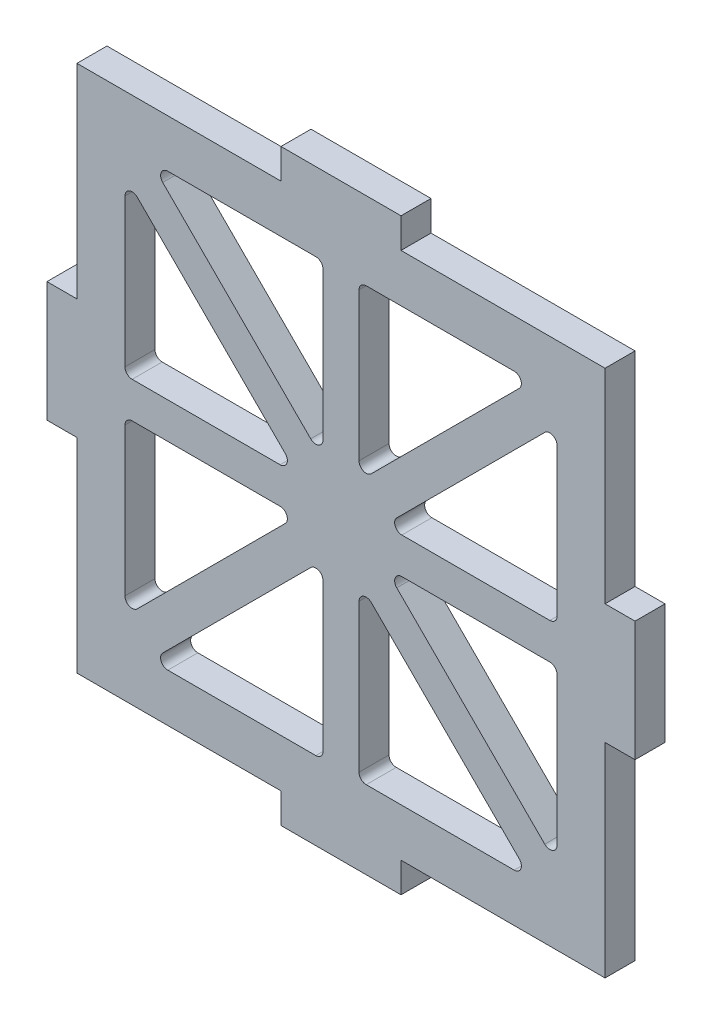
ISO-10303-21;
HEADER;
FILE_DESCRIPTION(('STEP AP214'),'2;1');
FILE_NAME('part.step','',(''),(''),'','','');
FILE_SCHEMA(('AUTOMOTIVE_DESIGN { 1 0 10303 214 1 1 1 1 }'));
ENDSEC;
DATA;
#1=APPLICATION_CONTEXT('core data for automotive mechanical design processes');
#2=APPLICATION_PROTOCOL_DEFINITION('international standard','automotive_design',2000,#1);
#3=PRODUCT_CONTEXT('',#1,'mechanical');
#4=PRODUCT('Part','Part','',(#3));
#5=PRODUCT_RELATED_PRODUCT_CATEGORY('part','',(#4));
#6=PRODUCT_DEFINITION_FORMATION('','',#4);
#7=PRODUCT_DEFINITION_CONTEXT('part definition',#1,'design');
#8=PRODUCT_DEFINITION('design','',#6,#7);
#9=PRODUCT_DEFINITION_SHAPE('','',#8);
#10=(LENGTH_UNIT() NAMED_UNIT(*) SI_UNIT(.MILLI.,.METRE.));
#11=(NAMED_UNIT(*) PLANE_ANGLE_UNIT() SI_UNIT($,.RADIAN.));
#12=(NAMED_UNIT(*) SI_UNIT($,.STERADIAN.) SOLID_ANGLE_UNIT());
#13=UNCERTAINTY_MEASURE_WITH_UNIT(LENGTH_MEASURE(1.E-05),#10,'distance_accuracy_value','');
#14=(GEOMETRIC_REPRESENTATION_CONTEXT(3) GLOBAL_UNCERTAINTY_ASSIGNED_CONTEXT((#13)) GLOBAL_UNIT_ASSIGNED_CONTEXT((#10,
#11,#12)) REPRESENTATION_CONTEXT('',''));
#15=CARTESIAN_POINT('',(0.,0.,0.));
#16=DIRECTION('',(0.,0.,1.));
#17=DIRECTION('',(1.,0.,0.));
#18=AXIS2_PLACEMENT_3D('',#15,#16,#17);
#19=CARTESIAN_POINT('',(-22.,0.,2.5));
#20=DIRECTION('',(1.,0.,0.));
#21=DIRECTION('',(0.,0.,-1.));
#22=AXIS2_PLACEMENT_3D('',#19,#20,#21);
#23=PLANE('',#22);
#24=DIRECTION('',(0.,0.,1.));
#25=VECTOR('',#24,1.);
#26=CARTESIAN_POINT('',(-22.,17.,-10.3077640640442));
#27=LINE('',#26,#25);
#28=CARTESIAN_POINT('',(-22.,17.,0.));
#29=VERTEX_POINT('',#28);
#30=CARTESIAN_POINT('',(-22.,17.,2.5));
#31=VERTEX_POINT('',#30);
#32=EDGE_CURVE('E864',#29,#31,#27,.T.);
#33=ORIENTED_EDGE('',*,*,#32,.F.);
#34=DIRECTION('',(0.,-1.,0.));
#35=VECTOR('',#34,1.);
#36=CARTESIAN_POINT('',(-22.,0.,0.));
#37=LINE('',#36,#35);
#38=CARTESIAN_POINT('',(-22.,0.,0.));
#39=VERTEX_POINT('',#38);
#40=EDGE_CURVE('E948',#29,#39,#37,.T.);
#41=ORIENTED_EDGE('',*,*,#40,.T.);
#42=DIRECTION('',(0.,0.,-1.));
#43=VECTOR('',#42,1.);
#44=CARTESIAN_POINT('',(-22.,0.,2.5));
#45=LINE('',#44,#43);
#46=CARTESIAN_POINT('',(-22.,0.,2.5));
#47=VERTEX_POINT('',#46);
#48=EDGE_CURVE('E11',#47,#39,#45,.T.);
#49=ORIENTED_EDGE('',*,*,#48,.F.);
#50=DIRECTION('',(0.,-1.,0.));
#51=VECTOR('',#50,1.);
#52=CARTESIAN_POINT('',(-22.,0.,2.5));
#53=LINE('',#52,#51);
#54=EDGE_CURVE('E953',#31,#47,#53,.T.);
#55=ORIENTED_EDGE('',*,*,#54,.F.);
#56=EDGE_LOOP('',(#33,#41,#49,#55));
#57=FACE_BOUND('',#56,.T.);
#58=ADVANCED_FACE('F35',(#57),#23,.F.);
#59=CARTESIAN_POINT('',(-22.,0.,2.5));
#60=DIRECTION('',(0.,1.,0.));
#61=DIRECTION('',(0.,0.,1.));
#62=AXIS2_PLACEMENT_3D('',#59,#60,#61);
#63=PLANE('',#62);
#64=DIRECTION('',(0.,0.,1.));
#65=VECTOR('',#64,1.);
#66=CARTESIAN_POINT('',(5.,0.,-10.3077640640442));
#67=LINE('',#66,#65);
#68=CARTESIAN_POINT('',(5.,0.,0.));
#69=VERTEX_POINT('',#68);
#70=CARTESIAN_POINT('',(5.,0.,2.5));
#71=VERTEX_POINT('',#70);
#72=EDGE_CURVE('E885',#69,#71,#67,.T.);
#73=ORIENTED_EDGE('',*,*,#72,.F.);
#74=DIRECTION('',(1.,0.,0.));
#75=VECTOR('',#74,1.);
#76=CARTESIAN_POINT('',(-22.,0.,0.));
#77=LINE('',#76,#75);
#78=CARTESIAN_POINT('',(22.,0.,0.));
#79=VERTEX_POINT('',#78);
#80=EDGE_CURVE('E969',#69,#79,#77,.T.);
#81=ORIENTED_EDGE('',*,*,#80,.T.);
#82=DIRECTION('',(0.,0.,-1.));
#83=VECTOR('',#82,1.);
#84=CARTESIAN_POINT('',(22.,0.,2.5));
#85=LINE('',#84,#83);
#86=CARTESIAN_POINT('',(22.,0.,2.5));
#87=VERTEX_POINT('',#86);
#88=EDGE_CURVE('E43',#87,#79,#85,.T.);
#89=ORIENTED_EDGE('',*,*,#88,.F.);
#90=DIRECTION('',(1.,0.,0.));
#91=VECTOR('',#90,1.);
#92=CARTESIAN_POINT('',(-22.,0.,2.5));
#93=LINE('',#92,#91);
#94=EDGE_CURVE('E952',#71,#87,#93,.T.);
#95=ORIENTED_EDGE('',*,*,#94,.F.);
#96=EDGE_LOOP('',(#73,#81,#89,#95));
#97=FACE_BOUND('',#96,.T.);
#98=ADVANCED_FACE('F1004',(#97),#63,.F.);
#99=CARTESIAN_POINT('',(22.,0.,2.5));
#100=DIRECTION('',(-1.,0.,0.));
#101=DIRECTION('',(0.,0.,1.));
#102=AXIS2_PLACEMENT_3D('',#99,#100,#101);
#103=PLANE('',#102);
#104=DIRECTION('',(0.,0.,1.));
#105=VECTOR('',#104,1.);
#106=CARTESIAN_POINT('',(22.,27.,-10.3077640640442));
#107=LINE('',#106,#105);
#108=CARTESIAN_POINT('',(22.,27.,0.));
#109=VERTEX_POINT('',#108);
#110=CARTESIAN_POINT('',(22.,27.,2.5));
#111=VERTEX_POINT('',#110);
#112=EDGE_CURVE('E911',#109,#111,#107,.T.);
#113=ORIENTED_EDGE('',*,*,#112,.F.);
#114=DIRECTION('',(0.,1.,0.));
#115=VECTOR('',#114,1.);
#116=CARTESIAN_POINT('',(22.,0.,0.));
#117=LINE('',#116,#115);
#118=CARTESIAN_POINT('',(22.,44.,0.));
#119=VERTEX_POINT('',#118);
#120=EDGE_CURVE('E973',#109,#119,#117,.T.);
#121=ORIENTED_EDGE('',*,*,#120,.T.);
#122=DIRECTION('',(0.,0.,-1.));
#123=VECTOR('',#122,1.);
#124=CARTESIAN_POINT('',(22.,44.,2.5));
#125=LINE('',#124,#123);
#126=CARTESIAN_POINT('',(22.,44.,2.5));
#127=VERTEX_POINT('',#126);
#128=EDGE_CURVE('E983',#127,#119,#125,.T.);
#129=ORIENTED_EDGE('',*,*,#128,.F.);
#130=DIRECTION('',(0.,1.,0.));
#131=VECTOR('',#130,1.);
#132=CARTESIAN_POINT('',(22.,0.,2.5));
#133=LINE('',#132,#131);
#134=EDGE_CURVE('E957',#111,#127,#133,.T.);
#135=ORIENTED_EDGE('',*,*,#134,.F.);
#136=EDGE_LOOP('',(#113,#121,#129,#135));
#137=FACE_BOUND('',#136,.T.);
#138=ADVANCED_FACE('F1063',(#137),#103,.F.);
#139=CARTESIAN_POINT('',(-22.,44.,2.5));
#140=DIRECTION('',(0.,-1.,0.));
#141=DIRECTION('',(0.,0.,-1.));
#142=AXIS2_PLACEMENT_3D('',#139,#140,#141);
#143=PLANE('',#142);
#144=DIRECTION('',(0.,0.,1.));
#145=VECTOR('',#144,1.);
#146=CARTESIAN_POINT('',(-4.99999999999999,44.,-10.3077640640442));
#147=LINE('',#146,#145);
#148=CARTESIAN_POINT('',(-4.99999999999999,44.,0.));
#149=VERTEX_POINT('',#148);
#150=CARTESIAN_POINT('',(-4.99999999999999,44.,2.5));
#151=VERTEX_POINT('',#150);
#152=EDGE_CURVE('E934',#149,#151,#147,.T.);
#153=ORIENTED_EDGE('',*,*,#152,.F.);
#154=DIRECTION('',(-1.,0.,0.));
#155=VECTOR('',#154,1.);
#156=CARTESIAN_POINT('',(-22.,44.,0.));
#157=LINE('',#156,#155);
#158=CARTESIAN_POINT('',(-22.,44.,0.));
#159=VERTEX_POINT('',#158);
#160=EDGE_CURVE('E977',#149,#159,#157,.T.);
#161=ORIENTED_EDGE('',*,*,#160,.T.);
#162=DIRECTION('',(0.,0.,-1.));
#163=VECTOR('',#162,1.);
#164=CARTESIAN_POINT('',(-22.,44.,2.5));
#165=LINE('',#164,#163);
#166=CARTESIAN_POINT('',(-22.,44.,2.5));
#167=VERTEX_POINT('',#166);
#168=EDGE_CURVE('E965',#167,#159,#165,.T.);
#169=ORIENTED_EDGE('',*,*,#168,.F.);
#170=DIRECTION('',(-1.,0.,0.));
#171=VECTOR('',#170,1.);
#172=CARTESIAN_POINT('',(-22.,44.,2.5));
#173=LINE('',#172,#171);
#174=EDGE_CURVE('E961',#151,#167,#173,.T.);
#175=ORIENTED_EDGE('',*,*,#174,.F.);
#176=EDGE_LOOP('',(#153,#161,#169,#175));
#177=FACE_BOUND('',#176,.T.);
#178=ADVANCED_FACE('F1042',(#177),#143,.F.);
#179=CARTESIAN_POINT('',(-22.,27.,0.));
#180=VERTEX_POINT('',#179);
#181=EDGE_CURVE('E966',#159,#180,#37,.T.);
#182=ORIENTED_EDGE('',*,*,#181,.T.);
#183=DIRECTION('',(0.,0.,1.));
#184=VECTOR('',#183,1.);
#185=CARTESIAN_POINT('',(-22.,27.,-10.3077640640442));
#186=LINE('',#185,#184);
#187=CARTESIAN_POINT('',(-22.,27.,2.5));
#188=VERTEX_POINT('',#187);
#189=EDGE_CURVE('E861',#180,#188,#186,.T.);
#190=ORIENTED_EDGE('',*,*,#189,.T.);
#191=EDGE_CURVE('E949',#167,#188,#53,.T.);
#192=ORIENTED_EDGE('',*,*,#191,.F.);
#193=ORIENTED_EDGE('',*,*,#168,.T.);
#194=EDGE_LOOP('',(#182,#190,#192,#193));
#195=FACE_BOUND('',#194,.T.);
#196=ADVANCED_FACE('F37',(#195),#23,.F.);
#197=CARTESIAN_POINT('',(-5.,0.,0.));
#198=VERTEX_POINT('',#197);
#199=EDGE_CURVE('E970',#39,#198,#77,.T.);
#200=ORIENTED_EDGE('',*,*,#199,.T.);
#201=DIRECTION('',(0.,0.,1.));
#202=VECTOR('',#201,1.);
#203=CARTESIAN_POINT('',(-5.,0.,-10.3077640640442));
#204=LINE('',#203,#202);
#205=CARTESIAN_POINT('',(-5.,0.,2.5));
#206=VERTEX_POINT('',#205);
#207=EDGE_CURVE('E891',#198,#206,#204,.T.);
#208=ORIENTED_EDGE('',*,*,#207,.T.);
#209=EDGE_CURVE('E954',#47,#206,#93,.T.);
#210=ORIENTED_EDGE('',*,*,#209,.F.);
#211=ORIENTED_EDGE('',*,*,#48,.T.);
#212=EDGE_LOOP('',(#200,#208,#210,#211));
#213=FACE_BOUND('',#212,.T.);
#214=ADVANCED_FACE('F1018',(#213),#63,.F.);
#215=CARTESIAN_POINT('',(22.,17.,0.));
#216=VERTEX_POINT('',#215);
#217=EDGE_CURVE('E974',#79,#216,#117,.T.);
#218=ORIENTED_EDGE('',*,*,#217,.T.);
#219=DIRECTION('',(0.,0.,1.));
#220=VECTOR('',#219,1.);
#221=CARTESIAN_POINT('',(22.,17.,-10.3077640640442));
#222=LINE('',#221,#220);
#223=CARTESIAN_POINT('',(22.,17.,2.5));
#224=VERTEX_POINT('',#223);
#225=EDGE_CURVE('E917',#216,#224,#222,.T.);
#226=ORIENTED_EDGE('',*,*,#225,.T.);
#227=EDGE_CURVE('E958',#87,#224,#133,.T.);
#228=ORIENTED_EDGE('',*,*,#227,.F.);
#229=ORIENTED_EDGE('',*,*,#88,.T.);
#230=EDGE_LOOP('',(#218,#226,#228,#229));
#231=FACE_BOUND('',#230,.T.);
#232=ADVANCED_FACE('F990',(#231),#103,.F.);
#233=CARTESIAN_POINT('',(4.99999999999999,44.,0.));
#234=VERTEX_POINT('',#233);
#235=EDGE_CURVE('E978',#119,#234,#157,.T.);
#236=ORIENTED_EDGE('',*,*,#235,.T.);
#237=DIRECTION('',(0.,0.,1.));
#238=VECTOR('',#237,1.);
#239=CARTESIAN_POINT('',(4.99999999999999,44.,-10.3077640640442));
#240=LINE('',#239,#238);
#241=CARTESIAN_POINT('',(4.99999999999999,44.,2.5));
#242=VERTEX_POINT('',#241);
#243=EDGE_CURVE('E926',#234,#242,#240,.T.);
#244=ORIENTED_EDGE('',*,*,#243,.T.);
#245=EDGE_CURVE('E962',#127,#242,#173,.T.);
#246=ORIENTED_EDGE('',*,*,#245,.F.);
#247=ORIENTED_EDGE('',*,*,#128,.T.);
#248=EDGE_LOOP('',(#236,#244,#246,#247));
#249=FACE_BOUND('',#248,.T.);
#250=ADVANCED_FACE('F1058',(#249),#143,.F.);
#251=CARTESIAN_POINT('',(0.,0.,2.5));
#252=DIRECTION('',(0.,0.,-1.));
#253=DIRECTION('',(-1.,0.,0.));
#254=AXIS2_PLACEMENT_3D('',#251,#252,#253);
#255=PLANE('',#254);
#256=CARTESIAN_POINT('',(-14.4301515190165,4.60000000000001,2.5));
#257=DIRECTION('',(0.,0.,1.));
#258=DIRECTION('',(1.,0.,0.));
#259=AXIS2_PLACEMENT_3D('',#256,#257,#258);
#260=CIRCLE('',#259,0.600000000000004);
#261=CARTESIAN_POINT('',(-14.8544155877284,5.02426406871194,2.5));
#262=VERTEX_POINT('',#261);
#263=CARTESIAN_POINT('',(-14.4301515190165,4.,2.5));
#264=VERTEX_POINT('',#263);
#265=EDGE_CURVE('E616',#262,#264,#260,.T.);
#266=ORIENTED_EDGE('',*,*,#265,.F.);
#267=DIRECTION('',(-0.707106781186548,-0.707106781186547,0.));
#268=VECTOR('',#267,1.);
#269=CARTESIAN_POINT('',(-2.52426406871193,17.3544155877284,2.5));
#270=LINE('',#269,#268);
#271=CARTESIAN_POINT('',(-2.52426406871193,17.3544155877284,2.5));
#272=VERTEX_POINT('',#271);
#273=EDGE_CURVE('E619',#272,#262,#270,.T.);
#274=ORIENTED_EDGE('',*,*,#273,.F.);
#275=CARTESIAN_POINT('',(-2.1,16.9301515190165,2.5));
#276=DIRECTION('',(0.,0.,1.));
#277=DIRECTION('',(-1.,0.,0.));
#278=AXIS2_PLACEMENT_3D('',#275,#276,#277);
#279=CIRCLE('',#278,0.600000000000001);
#280=CARTESIAN_POINT('',(-1.5,16.9301515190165,2.5));
#281=VERTEX_POINT('',#280);
#282=EDGE_CURVE('E622',#281,#272,#279,.T.);
#283=ORIENTED_EDGE('',*,*,#282,.F.);
#284=DIRECTION('',(0.,1.,0.));
#285=VECTOR('',#284,1.);
#286=CARTESIAN_POINT('',(-1.5,4.60000000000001,2.5));
#287=LINE('',#286,#285);
#288=CARTESIAN_POINT('',(-1.5,4.60000000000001,2.5));
#289=VERTEX_POINT('',#288);
#290=EDGE_CURVE('E50',#289,#281,#287,.T.);
#291=ORIENTED_EDGE('',*,*,#290,.F.);
#292=CARTESIAN_POINT('',(-2.1,4.60000000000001,2.5));
#293=DIRECTION('',(0.,0.,1.));
#294=DIRECTION('',(-1.,0.,0.));
#295=AXIS2_PLACEMENT_3D('',#292,#293,#294);
#296=CIRCLE('',#295,0.600000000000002);
#297=CARTESIAN_POINT('',(-2.1,4.,2.5));
#298=VERTEX_POINT('',#297);
#299=EDGE_CURVE('E610',#298,#289,#296,.T.);
#300=ORIENTED_EDGE('',*,*,#299,.F.);
#301=DIRECTION('',(1.,0.,0.));
#302=VECTOR('',#301,1.);
#303=CARTESIAN_POINT('',(-14.4301515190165,4.,2.5));
#304=LINE('',#303,#302);
#305=EDGE_CURVE('E613',#264,#298,#304,.T.);
#306=ORIENTED_EDGE('',*,*,#305,.F.);
#307=EDGE_LOOP('',(#266,#274,#283,#291,#300,#306));
#308=FACE_BOUND('',#307,.T.);
#309=CARTESIAN_POINT('',(2.1,16.9301515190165,2.5));
#310=DIRECTION('',(0.,0.,1.));
#311=DIRECTION('',(1.,0.,0.));
#312=AXIS2_PLACEMENT_3D('',#309,#310,#311);
#313=CIRCLE('',#312,0.600000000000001);
#314=CARTESIAN_POINT('',(2.52426406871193,17.3544155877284,2.5));
#315=VERTEX_POINT('',#314);
#316=CARTESIAN_POINT('',(1.5,16.9301515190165,2.5));
#317=VERTEX_POINT('',#316);
#318=EDGE_CURVE('E570',#315,#317,#313,.T.);
#319=ORIENTED_EDGE('',*,*,#318,.F.);
#320=DIRECTION('',(-0.707106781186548,0.707106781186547,0.));
#321=VECTOR('',#320,1.);
#322=CARTESIAN_POINT('',(2.52426406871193,17.3544155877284,2.5));
#323=LINE('',#322,#321);
#324=CARTESIAN_POINT('',(14.8544155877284,5.02426406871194,2.5));
#325=VERTEX_POINT('',#324);
#326=EDGE_CURVE('E573',#325,#315,#323,.T.);
#327=ORIENTED_EDGE('',*,*,#326,.F.);
#328=CARTESIAN_POINT('',(14.4301515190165,4.60000000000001,2.5));
#329=DIRECTION('',(0.,0.,1.));
#330=DIRECTION('',(-1.,0.,0.));
#331=AXIS2_PLACEMENT_3D('',#328,#329,#330);
#332=CIRCLE('',#331,0.600000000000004);
#333=CARTESIAN_POINT('',(14.4301515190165,4.,2.5));
#334=VERTEX_POINT('',#333);
#335=EDGE_CURVE('E576',#334,#325,#332,.T.);
#336=ORIENTED_EDGE('',*,*,#335,.F.);
#337=DIRECTION('',(1.,0.,0.));
#338=VECTOR('',#337,1.);
#339=CARTESIAN_POINT('',(14.4301515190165,4.,2.5));
#340=LINE('',#339,#338);
#341=CARTESIAN_POINT('',(2.1,4.00000000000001,2.5));
#342=VERTEX_POINT('',#341);
#343=EDGE_CURVE('E58',#342,#334,#340,.T.);
#344=ORIENTED_EDGE('',*,*,#343,.F.);
#345=CARTESIAN_POINT('',(2.1,4.60000000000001,2.5));
#346=DIRECTION('',(0.,0.,1.));
#347=DIRECTION('',(1.,0.,0.));
#348=AXIS2_PLACEMENT_3D('',#345,#346,#347);
#349=CIRCLE('',#348,0.600000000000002);
#350=CARTESIAN_POINT('',(1.5,4.60000000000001,2.5));
#351=VERTEX_POINT('',#350);
#352=EDGE_CURVE('E564',#351,#342,#349,.T.);
#353=ORIENTED_EDGE('',*,*,#352,.F.);
#354=DIRECTION('',(0.,-1.,0.));
#355=VECTOR('',#354,1.);
#356=CARTESIAN_POINT('',(1.5,4.60000000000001,2.5));
#357=LINE('',#356,#355);
#358=EDGE_CURVE('E567',#317,#351,#357,.T.);
#359=ORIENTED_EDGE('',*,*,#358,.F.);
#360=EDGE_LOOP('',(#319,#327,#336,#344,#353,#359));
#361=FACE_BOUND('',#360,.T.);
#362=CARTESIAN_POINT('',(14.4301515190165,39.4,2.5));
#363=DIRECTION('',(0.,0.,1.));
#364=DIRECTION('',(1.,0.,0.));
#365=AXIS2_PLACEMENT_3D('',#362,#363,#364);
#366=CIRCLE('',#365,0.600000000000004);
#367=CARTESIAN_POINT('',(14.8544155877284,38.9757359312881,2.5));
#368=VERTEX_POINT('',#367);
#369=CARTESIAN_POINT('',(14.4301515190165,40.,2.5));
#370=VERTEX_POINT('',#369);
#371=EDGE_CURVE('E522',#368,#370,#366,.T.);
#372=ORIENTED_EDGE('',*,*,#371,.F.);
#373=DIRECTION('',(0.707106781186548,0.707106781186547,0.));
#374=VECTOR('',#373,1.);
#375=CARTESIAN_POINT('',(2.52426406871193,26.6455844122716,2.5));
#376=LINE('',#375,#374);
#377=CARTESIAN_POINT('',(2.52426406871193,26.6455844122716,2.5));
#378=VERTEX_POINT('',#377);
#379=EDGE_CURVE('E525',#378,#368,#376,.T.);
#380=ORIENTED_EDGE('',*,*,#379,.F.);
#381=CARTESIAN_POINT('',(2.1,27.0698484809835,2.5));
#382=DIRECTION('',(0.,0.,1.));
#383=DIRECTION('',(-1.,0.,0.));
#384=AXIS2_PLACEMENT_3D('',#381,#382,#383);
#385=CIRCLE('',#384,0.600000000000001);
#386=CARTESIAN_POINT('',(1.5,27.0698484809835,2.5));
#387=VERTEX_POINT('',#386);
#388=EDGE_CURVE('E528',#387,#378,#385,.T.);
#389=ORIENTED_EDGE('',*,*,#388,.F.);
#390=DIRECTION('',(0.,-1.,0.));
#391=VECTOR('',#390,1.);
#392=CARTESIAN_POINT('',(1.5,39.4,2.5));
#393=LINE('',#392,#391);
#394=CARTESIAN_POINT('',(1.5,39.4,2.5));
#395=VERTEX_POINT('',#394);
#396=EDGE_CURVE('E513',#395,#387,#393,.T.);
#397=ORIENTED_EDGE('',*,*,#396,.F.);
#398=CARTESIAN_POINT('',(2.1,39.4,2.5));
#399=DIRECTION('',(0.,0.,1.));
#400=DIRECTION('',(-1.,0.,0.));
#401=AXIS2_PLACEMENT_3D('',#398,#399,#400);
#402=CIRCLE('',#401,0.600000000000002);
#403=CARTESIAN_POINT('',(2.1,40.,2.5));
#404=VERTEX_POINT('',#403);
#405=EDGE_CURVE('E516',#404,#395,#402,.T.);
#406=ORIENTED_EDGE('',*,*,#405,.F.);
#407=DIRECTION('',(-1.,0.,0.));
#408=VECTOR('',#407,1.);
#409=CARTESIAN_POINT('',(14.4301515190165,40.,2.5));
#410=LINE('',#409,#408);
#411=EDGE_CURVE('E519',#370,#404,#410,.T.);
#412=ORIENTED_EDGE('',*,*,#411,.F.);
#413=EDGE_LOOP('',(#372,#380,#389,#397,#406,#412));
#414=FACE_BOUND('',#413,.T.);
#415=CARTESIAN_POINT('',(-2.1,27.0698484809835,2.5));
#416=DIRECTION('',(0.,0.,1.));
#417=DIRECTION('',(1.,0.,0.));
#418=AXIS2_PLACEMENT_3D('',#415,#416,#417);
#419=CIRCLE('',#418,0.600000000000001);
#420=CARTESIAN_POINT('',(-2.52426406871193,26.6455844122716,2.5));
#421=VERTEX_POINT('',#420);
#422=CARTESIAN_POINT('',(-1.5,27.0698484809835,2.5));
#423=VERTEX_POINT('',#422);
#424=EDGE_CURVE('E1760',#421,#423,#419,.T.);
#425=ORIENTED_EDGE('',*,*,#424,.F.);
#426=DIRECTION('',(0.707106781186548,-0.707106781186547,0.));
#427=VECTOR('',#426,1.);
#428=CARTESIAN_POINT('',(-2.52426406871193,26.6455844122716,2.5));
#429=LINE('',#428,#427);
#430=CARTESIAN_POINT('',(-14.8544155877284,38.9757359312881,2.5));
#431=VERTEX_POINT('',#430);
#432=EDGE_CURVE('E479',#431,#421,#429,.T.);
#433=ORIENTED_EDGE('',*,*,#432,.F.);
#434=CARTESIAN_POINT('',(-14.4301515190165,39.4,2.5));
#435=DIRECTION('',(0.,0.,1.));
#436=DIRECTION('',(-1.,0.,0.));
#437=AXIS2_PLACEMENT_3D('',#434,#435,#436);
#438=CIRCLE('',#437,0.600000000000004);
#439=CARTESIAN_POINT('',(-14.4301515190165,40.,2.5));
#440=VERTEX_POINT('',#439);
#441=EDGE_CURVE('E492',#440,#431,#438,.T.);
#442=ORIENTED_EDGE('',*,*,#441,.F.);
#443=DIRECTION('',(-1.,0.,0.));
#444=VECTOR('',#443,1.);
#445=CARTESIAN_POINT('',(-14.4301515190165,40.,2.5));
#446=LINE('',#445,#444);
#447=CARTESIAN_POINT('',(-2.1,40.,2.5));
#448=VERTEX_POINT('',#447);
#449=EDGE_CURVE('E486',#448,#440,#446,.T.);
#450=ORIENTED_EDGE('',*,*,#449,.F.);
#451=CARTESIAN_POINT('',(-2.1,39.4,2.5));
#452=DIRECTION('',(0.,0.,1.));
#453=DIRECTION('',(1.,0.,0.));
#454=AXIS2_PLACEMENT_3D('',#451,#452,#453);
#455=CIRCLE('',#454,0.600000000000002);
#456=CARTESIAN_POINT('',(-1.5,39.4,2.5));
#457=VERTEX_POINT('',#456);
#458=EDGE_CURVE('E488',#457,#448,#455,.T.);
#459=ORIENTED_EDGE('',*,*,#458,.F.);
#460=DIRECTION('',(0.,1.,0.));
#461=VECTOR('',#460,1.);
#462=CARTESIAN_POINT('',(-1.5,39.4,2.5));
#463=LINE('',#462,#461);
#464=EDGE_CURVE('E1818',#423,#457,#463,.T.);
#465=ORIENTED_EDGE('',*,*,#464,.F.);
#466=EDGE_LOOP('',(#425,#433,#442,#450,#459,#465));
#467=FACE_BOUND('',#466,.T.);
#468=CARTESIAN_POINT('',(5.0698484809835,24.1,2.5));
#469=DIRECTION('',(0.,0.,1.));
#470=DIRECTION('',(-1.,0.,0.));
#471=AXIS2_PLACEMENT_3D('',#468,#469,#470);
#472=CIRCLE('',#471,0.600000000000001);
#473=CARTESIAN_POINT('',(4.64558441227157,24.5242640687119,2.5));
#474=VERTEX_POINT('',#473);
#475=CARTESIAN_POINT('',(5.0698484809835,23.5,2.5));
#476=VERTEX_POINT('',#475);
#477=EDGE_CURVE('E760',#474,#476,#472,.T.);
#478=ORIENTED_EDGE('',*,*,#477,.F.);
#479=DIRECTION('',(-0.707106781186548,-0.707106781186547,0.));
#480=VECTOR('',#479,1.);
#481=CARTESIAN_POINT('',(4.64558441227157,24.5242640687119,2.5));
#482=LINE('',#481,#480);
#483=CARTESIAN_POINT('',(16.9757359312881,36.8544155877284,2.5));
#484=VERTEX_POINT('',#483);
#485=EDGE_CURVE('E763',#484,#474,#482,.T.);
#486=ORIENTED_EDGE('',*,*,#485,.F.);
#487=CARTESIAN_POINT('',(17.4,36.4301515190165,2.5));
#488=DIRECTION('',(0.,0.,1.));
#489=DIRECTION('',(1.,0.,0.));
#490=AXIS2_PLACEMENT_3D('',#487,#488,#489);
#491=CIRCLE('',#490,0.600000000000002);
#492=CARTESIAN_POINT('',(18.,36.4301515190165,2.5));
#493=VERTEX_POINT('',#492);
#494=EDGE_CURVE('E512',#493,#484,#491,.T.);
#495=ORIENTED_EDGE('',*,*,#494,.F.);
#496=DIRECTION('',(0.,1.,0.));
#497=VECTOR('',#496,1.);
#498=CARTESIAN_POINT('',(18.,36.4301515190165,2.5));
#499=LINE('',#498,#497);
#500=CARTESIAN_POINT('',(18.,24.1,2.5));
#501=VERTEX_POINT('',#500);
#502=EDGE_CURVE('E751',#501,#493,#499,.T.);
#503=ORIENTED_EDGE('',*,*,#502,.F.);
#504=CARTESIAN_POINT('',(17.4,24.1,2.5));
#505=DIRECTION('',(0.,0.,1.));
#506=DIRECTION('',(-1.,0.,0.));
#507=AXIS2_PLACEMENT_3D('',#504,#505,#506);
#508=CIRCLE('',#507,0.6);
#509=CARTESIAN_POINT('',(17.4,23.5,2.5));
#510=VERTEX_POINT('',#509);
#511=EDGE_CURVE('E754',#510,#501,#508,.T.);
#512=ORIENTED_EDGE('',*,*,#511,.F.);
#513=DIRECTION('',(1.,0.,0.));
#514=VECTOR('',#513,1.);
#515=CARTESIAN_POINT('',(17.4,23.5,2.5));
#516=LINE('',#515,#514);
#517=EDGE_CURVE('E757',#476,#510,#516,.T.);
#518=ORIENTED_EDGE('',*,*,#517,.F.);
#519=EDGE_LOOP('',(#478,#486,#495,#503,#512,#518));
#520=FACE_BOUND('',#519,.T.);
#521=CARTESIAN_POINT('',(5.0698484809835,19.9,2.5));
#522=DIRECTION('',(0.,0.,1.));
#523=DIRECTION('',(1.,0.,0.));
#524=AXIS2_PLACEMENT_3D('',#521,#522,#523);
#525=CIRCLE('',#524,0.600000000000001);
#526=CARTESIAN_POINT('',(5.0698484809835,20.5,2.5));
#527=VERTEX_POINT('',#526);
#528=CARTESIAN_POINT('',(4.64558441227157,19.4757359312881,2.5));
#529=VERTEX_POINT('',#528);
#530=EDGE_CURVE('E712',#527,#529,#525,.T.);
#531=ORIENTED_EDGE('',*,*,#530,.F.);
#532=DIRECTION('',(-1.,0.,0.));
#533=VECTOR('',#532,1.);
#534=CARTESIAN_POINT('',(17.4,20.5,2.5));
#535=LINE('',#534,#533);
#536=CARTESIAN_POINT('',(17.4,20.5,2.5));
#537=VERTEX_POINT('',#536);
#538=EDGE_CURVE('E715',#537,#527,#535,.T.);
#539=ORIENTED_EDGE('',*,*,#538,.F.);
#540=CARTESIAN_POINT('',(17.4,19.9,2.5));
#541=DIRECTION('',(0.,0.,1.));
#542=DIRECTION('',(1.,0.,0.));
#543=AXIS2_PLACEMENT_3D('',#540,#541,#542);
#544=CIRCLE('',#543,0.6);
#545=CARTESIAN_POINT('',(18.,19.9,2.5));
#546=VERTEX_POINT('',#545);
#547=EDGE_CURVE('E718',#546,#537,#544,.T.);
#548=ORIENTED_EDGE('',*,*,#547,.F.);
#549=DIRECTION('',(0.,1.,0.));
#550=VECTOR('',#549,1.);
#551=CARTESIAN_POINT('',(18.,7.56984848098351,2.5));
#552=LINE('',#551,#550);
#553=CARTESIAN_POINT('',(18.,7.56984848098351,2.5));
#554=VERTEX_POINT('',#553);
#555=EDGE_CURVE('E703',#554,#546,#552,.T.);
#556=ORIENTED_EDGE('',*,*,#555,.F.);
#557=CARTESIAN_POINT('',(17.4,7.56984848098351,2.5));
#558=DIRECTION('',(0.,0.,1.));
#559=DIRECTION('',(-1.,0.,0.));
#560=AXIS2_PLACEMENT_3D('',#557,#558,#559);
#561=CIRCLE('',#560,0.600000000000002);
#562=CARTESIAN_POINT('',(16.9757359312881,7.14558441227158,2.5));
#563=VERTEX_POINT('',#562);
#564=EDGE_CURVE('E706',#563,#554,#561,.T.);
#565=ORIENTED_EDGE('',*,*,#564,.F.);
#566=DIRECTION('',(0.707106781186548,-0.707106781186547,0.));
#567=VECTOR('',#566,1.);
#568=CARTESIAN_POINT('',(4.64558441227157,19.4757359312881,2.5));
#569=LINE('',#568,#567);
#570=EDGE_CURVE('E709',#529,#563,#569,.T.);
#571=ORIENTED_EDGE('',*,*,#570,.F.);
#572=EDGE_LOOP('',(#531,#539,#548,#556,#565,#571));
#573=FACE_BOUND('',#572,.T.);
#574=CARTESIAN_POINT('',(-5.0698484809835,19.9,2.5));
#575=DIRECTION('',(0.,0.,1.));
#576=DIRECTION('',(-1.,0.,0.));
#577=AXIS2_PLACEMENT_3D('',#574,#575,#576);
#578=CIRCLE('',#577,0.600000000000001);
#579=CARTESIAN_POINT('',(-4.64558441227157,19.4757359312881,2.5));
#580=VERTEX_POINT('',#579);
#581=CARTESIAN_POINT('',(-5.0698484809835,20.5,2.5));
#582=VERTEX_POINT('',#581);
#583=EDGE_CURVE('E662',#580,#582,#578,.T.);
#584=ORIENTED_EDGE('',*,*,#583,.F.);
#585=DIRECTION('',(0.707106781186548,0.707106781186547,0.));
#586=VECTOR('',#585,1.);
#587=CARTESIAN_POINT('',(-4.64558441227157,19.4757359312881,2.5));
#588=LINE('',#587,#586);
#589=CARTESIAN_POINT('',(-16.9757359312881,7.14558441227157,2.5));
#590=VERTEX_POINT('',#589);
#591=EDGE_CURVE('E665',#590,#580,#588,.T.);
#592=ORIENTED_EDGE('',*,*,#591,.F.);
#593=CARTESIAN_POINT('',(-17.4,7.56984848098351,2.5));
#594=DIRECTION('',(0.,0.,1.));
#595=DIRECTION('',(1.,0.,0.));
#596=AXIS2_PLACEMENT_3D('',#593,#594,#595);
#597=CIRCLE('',#596,0.600000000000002);
#598=CARTESIAN_POINT('',(-18.,7.56984848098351,2.5));
#599=VERTEX_POINT('',#598);
#600=EDGE_CURVE('E668',#599,#590,#597,.T.);
#601=ORIENTED_EDGE('',*,*,#600,.F.);
#602=DIRECTION('',(0.,-1.,0.));
#603=VECTOR('',#602,1.);
#604=CARTESIAN_POINT('',(-18.,7.56984848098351,2.5));
#605=LINE('',#604,#603);
#606=CARTESIAN_POINT('',(-18.,19.9,2.5));
#607=VERTEX_POINT('',#606);
#608=EDGE_CURVE('E653',#607,#599,#605,.T.);
#609=ORIENTED_EDGE('',*,*,#608,.F.);
#610=CARTESIAN_POINT('',(-17.4,19.9,2.5));
#611=DIRECTION('',(0.,0.,1.));
#612=DIRECTION('',(-1.,0.,0.));
#613=AXIS2_PLACEMENT_3D('',#610,#611,#612);
#614=CIRCLE('',#613,0.6);
#615=CARTESIAN_POINT('',(-17.4,20.5,2.5));
#616=VERTEX_POINT('',#615);
#617=EDGE_CURVE('E656',#616,#607,#614,.T.);
#618=ORIENTED_EDGE('',*,*,#617,.F.);
#619=DIRECTION('',(-1.,0.,0.));
#620=VECTOR('',#619,1.);
#621=CARTESIAN_POINT('',(-17.4,20.5,2.5));
#622=LINE('',#621,#620);
#623=EDGE_CURVE('E659',#582,#616,#622,.T.);
#624=ORIENTED_EDGE('',*,*,#623,.F.);
#625=EDGE_LOOP('',(#584,#592,#601,#609,#618,#624));
#626=FACE_BOUND('',#625,.T.);
#627=CARTESIAN_POINT('',(-5.0698484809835,24.1,2.5));
#628=DIRECTION('',(0.,0.,1.));
#629=DIRECTION('',(1.,0.,0.));
#630=AXIS2_PLACEMENT_3D('',#627,#628,#629);
#631=CIRCLE('',#630,0.600000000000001);
#632=CARTESIAN_POINT('',(-5.0698484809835,23.5,2.5));
#633=VERTEX_POINT('',#632);
#634=CARTESIAN_POINT('',(-4.64558441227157,24.5242640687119,2.5));
#635=VERTEX_POINT('',#634);
#636=EDGE_CURVE('E806',#633,#635,#631,.T.);
#637=ORIENTED_EDGE('',*,*,#636,.F.);
#638=DIRECTION('',(1.,0.,0.));
#639=VECTOR('',#638,1.);
#640=CARTESIAN_POINT('',(-17.4,23.5,2.5));
#641=LINE('',#640,#639);
#642=CARTESIAN_POINT('',(-17.4,23.5,2.5));
#643=VERTEX_POINT('',#642);
#644=EDGE_CURVE('E809',#643,#633,#641,.T.);
#645=ORIENTED_EDGE('',*,*,#644,.F.);
#646=CARTESIAN_POINT('',(-17.4,24.1,2.5));
#647=DIRECTION('',(0.,0.,1.));
#648=DIRECTION('',(1.,0.,0.));
#649=AXIS2_PLACEMENT_3D('',#646,#647,#648);
#650=CIRCLE('',#649,0.6);
#651=CARTESIAN_POINT('',(-18.,24.1,2.5));
#652=VERTEX_POINT('',#651);
#653=EDGE_CURVE('E702',#652,#643,#650,.T.);
#654=ORIENTED_EDGE('',*,*,#653,.F.);
#655=DIRECTION('',(0.,-1.,0.));
#656=VECTOR('',#655,1.);
#657=CARTESIAN_POINT('',(-18.,36.4301515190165,2.5));
#658=LINE('',#657,#656);
#659=CARTESIAN_POINT('',(-18.,36.4301515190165,2.5));
#660=VERTEX_POINT('',#659);
#661=EDGE_CURVE('E797',#660,#652,#658,.T.);
#662=ORIENTED_EDGE('',*,*,#661,.F.);
#663=CARTESIAN_POINT('',(-17.4,36.4301515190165,2.5));
#664=DIRECTION('',(0.,0.,1.));
#665=DIRECTION('',(-1.,0.,0.));
#666=AXIS2_PLACEMENT_3D('',#663,#664,#665);
#667=CIRCLE('',#666,0.600000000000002);
#668=CARTESIAN_POINT('',(-16.9757359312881,36.8544155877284,2.5));
#669=VERTEX_POINT('',#668);
#670=EDGE_CURVE('E800',#669,#660,#667,.T.);
#671=ORIENTED_EDGE('',*,*,#670,.F.);
#672=DIRECTION('',(-0.707106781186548,0.707106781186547,0.));
#673=VECTOR('',#672,1.);
#674=CARTESIAN_POINT('',(-4.64558441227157,24.5242640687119,2.5));
#675=LINE('',#674,#673);
#676=EDGE_CURVE('E803',#635,#669,#675,.T.);
#677=ORIENTED_EDGE('',*,*,#676,.F.);
#678=EDGE_LOOP('',(#637,#645,#654,#662,#671,#677));
#679=FACE_BOUND('',#678,.T.);
#680=ORIENTED_EDGE('',*,*,#191,.T.);
#681=DIRECTION('',(-1.,0.,0.));
#682=VECTOR('',#681,1.);
#683=CARTESIAN_POINT('',(-22.,27.,2.5));
#684=LINE('',#683,#682);
#685=CARTESIAN_POINT('',(-24.5,27.,2.5));
#686=VERTEX_POINT('',#685);
#687=EDGE_CURVE('E844',#188,#686,#684,.T.);
#688=ORIENTED_EDGE('',*,*,#687,.T.);
#689=DIRECTION('',(0.,-1.,0.));
#690=VECTOR('',#689,1.);
#691=CARTESIAN_POINT('',(-24.5,27.,2.5));
#692=LINE('',#691,#690);
#693=CARTESIAN_POINT('',(-24.5,17.,2.5));
#694=VERTEX_POINT('',#693);
#695=EDGE_CURVE('E849',#686,#694,#692,.T.);
#696=ORIENTED_EDGE('',*,*,#695,.T.);
#697=DIRECTION('',(1.,0.,0.));
#698=VECTOR('',#697,1.);
#699=CARTESIAN_POINT('',(-22.,17.,2.5));
#700=LINE('',#699,#698);
#701=EDGE_CURVE('E845',#694,#31,#700,.T.);
#702=ORIENTED_EDGE('',*,*,#701,.T.);
#703=ORIENTED_EDGE('',*,*,#54,.T.);
#704=ORIENTED_EDGE('',*,*,#209,.T.);
#705=DIRECTION('',(0.,-1.,0.));
#706=VECTOR('',#705,1.);
#707=CARTESIAN_POINT('',(-5.,0.,2.5));
#708=LINE('',#707,#706);
#709=CARTESIAN_POINT('',(-5.00000000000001,-2.5,2.5));
#710=VERTEX_POINT('',#709);
#711=EDGE_CURVE('E870',#206,#710,#708,.T.);
#712=ORIENTED_EDGE('',*,*,#711,.T.);
#713=DIRECTION('',(1.,0.,0.));
#714=VECTOR('',#713,1.);
#715=CARTESIAN_POINT('',(-5.00000000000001,-2.5,2.5));
#716=LINE('',#715,#714);
#717=CARTESIAN_POINT('',(4.99999999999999,-2.5,2.5));
#718=VERTEX_POINT('',#717);
#719=EDGE_CURVE('E875',#710,#718,#716,.T.);
#720=ORIENTED_EDGE('',*,*,#719,.T.);
#721=DIRECTION('',(0.,1.,0.));
#722=VECTOR('',#721,1.);
#723=CARTESIAN_POINT('',(5.,0.,2.5));
#724=LINE('',#723,#722);
#725=EDGE_CURVE('E871',#718,#71,#724,.T.);
#726=ORIENTED_EDGE('',*,*,#725,.T.);
#727=ORIENTED_EDGE('',*,*,#94,.T.);
#728=ORIENTED_EDGE('',*,*,#227,.T.);
#729=DIRECTION('',(1.,0.,0.));
#730=VECTOR('',#729,1.);
#731=CARTESIAN_POINT('',(22.,17.,2.5));
#732=LINE('',#731,#730);
#733=CARTESIAN_POINT('',(24.5,17.,2.5));
#734=VERTEX_POINT('',#733);
#735=EDGE_CURVE('E896',#224,#734,#732,.T.);
#736=ORIENTED_EDGE('',*,*,#735,.T.);
#737=DIRECTION('',(0.,1.,0.));
#738=VECTOR('',#737,1.);
#739=CARTESIAN_POINT('',(24.5,27.,2.5));
#740=LINE('',#739,#738);
#741=CARTESIAN_POINT('',(24.5,27.,2.5));
#742=VERTEX_POINT('',#741);
#743=EDGE_CURVE('E901',#734,#742,#740,.T.);
#744=ORIENTED_EDGE('',*,*,#743,.T.);
#745=DIRECTION('',(-1.,0.,0.));
#746=VECTOR('',#745,1.);
#747=CARTESIAN_POINT('',(22.,27.,2.5));
#748=LINE('',#747,#746);
#749=EDGE_CURVE('E897',#742,#111,#748,.T.);
#750=ORIENTED_EDGE('',*,*,#749,.T.);
#751=ORIENTED_EDGE('',*,*,#134,.T.);
#752=ORIENTED_EDGE('',*,*,#245,.T.);
#753=DIRECTION('',(0.,1.,0.));
#754=VECTOR('',#753,1.);
#755=CARTESIAN_POINT('',(4.99999999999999,44.,2.5));
#756=LINE('',#755,#754);
#757=CARTESIAN_POINT('',(4.99999999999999,46.5,2.5));
#758=VERTEX_POINT('',#757);
#759=EDGE_CURVE('E927',#242,#758,#756,.T.);
#760=ORIENTED_EDGE('',*,*,#759,.T.);
#761=DIRECTION('',(-1.,0.,0.));
#762=VECTOR('',#761,1.);
#763=CARTESIAN_POINT('',(-5.00000000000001,46.5,2.5));
#764=LINE('',#763,#762);
#765=CARTESIAN_POINT('',(-5.00000000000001,46.5,2.5));
#766=VERTEX_POINT('',#765);
#767=EDGE_CURVE('E923',#758,#766,#764,.T.);
#768=ORIENTED_EDGE('',*,*,#767,.T.);
#769=DIRECTION('',(0.,-1.,0.));
#770=VECTOR('',#769,1.);
#771=CARTESIAN_POINT('',(-4.99999999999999,44.,2.5));
#772=LINE('',#771,#770);
#773=EDGE_CURVE('E922',#766,#151,#772,.T.);
#774=ORIENTED_EDGE('',*,*,#773,.T.);
#775=ORIENTED_EDGE('',*,*,#174,.T.);
#776=EDGE_LOOP('',(#680,#688,#696,#702,#703,#704,#712,#720,#726,#727,#728,#736,#744,#750,#751,
#752,#760,#768,#774,#775));
#777=FACE_BOUND('',#776,.T.);
#778=ADVANCED_FACE('F1001',(#308,#361,#414,#467,#520,#573,#626,#679,#777),#255,.F.);
#779=CARTESIAN_POINT('',(0.,0.,0.));
#780=DIRECTION('',(0.,0.,-1.));
#781=DIRECTION('',(-1.,0.,0.));
#782=AXIS2_PLACEMENT_3D('',#779,#780,#781);
#783=PLANE('',#782);
#784=DIRECTION('',(-0.707106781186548,-0.707106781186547,0.));
#785=VECTOR('',#784,1.);
#786=CARTESIAN_POINT('',(-2.52426406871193,17.3544155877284,0.));
#787=LINE('',#786,#785);
#788=CARTESIAN_POINT('',(-2.52426406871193,17.3544155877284,0.));
#789=VERTEX_POINT('',#788);
#790=CARTESIAN_POINT('',(-14.8544155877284,5.02426406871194,0.));
#791=VERTEX_POINT('',#790);
#792=EDGE_CURVE('E609',#789,#791,#787,.T.);
#793=ORIENTED_EDGE('',*,*,#792,.T.);
#794=CARTESIAN_POINT('',(-14.4301515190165,4.60000000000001,0.));
#795=DIRECTION('',(0.,0.,-1.));
#796=DIRECTION('',(-1.,0.,0.));
#797=AXIS2_PLACEMENT_3D('',#794,#795,#796);
#798=CIRCLE('',#797,0.600000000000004);
#799=CARTESIAN_POINT('',(-14.4301515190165,4.,0.));
#800=VERTEX_POINT('',#799);
#801=EDGE_CURVE('E644',#791,#800,#798,.F.);
#802=ORIENTED_EDGE('',*,*,#801,.T.);
#803=DIRECTION('',(1.,0.,0.));
#804=VECTOR('',#803,1.);
#805=CARTESIAN_POINT('',(-14.4301515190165,4.,0.));
#806=LINE('',#805,#804);
#807=CARTESIAN_POINT('',(-2.1,4.,0.));
#808=VERTEX_POINT('',#807);
#809=EDGE_CURVE('E640',#800,#808,#806,.T.);
#810=ORIENTED_EDGE('',*,*,#809,.T.);
#811=CARTESIAN_POINT('',(-2.1,4.60000000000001,0.));
#812=DIRECTION('',(0.,0.,-1.));
#813=DIRECTION('',(-1.,0.,0.));
#814=AXIS2_PLACEMENT_3D('',#811,#812,#813);
#815=CIRCLE('',#814,0.600000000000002);
#816=CARTESIAN_POINT('',(-1.5,4.60000000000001,0.));
#817=VERTEX_POINT('',#816);
#818=EDGE_CURVE('E636',#808,#817,#815,.F.);
#819=ORIENTED_EDGE('',*,*,#818,.T.);
#820=DIRECTION('',(0.,1.,0.));
#821=VECTOR('',#820,1.);
#822=CARTESIAN_POINT('',(-1.5,4.60000000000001,0.));
#823=LINE('',#822,#821);
#824=CARTESIAN_POINT('',(-1.5,16.9301515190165,0.));
#825=VERTEX_POINT('',#824);
#826=EDGE_CURVE('E632',#817,#825,#823,.T.);
#827=ORIENTED_EDGE('',*,*,#826,.T.);
#828=CARTESIAN_POINT('',(-2.1,16.9301515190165,0.));
#829=DIRECTION('',(0.,0.,-1.));
#830=DIRECTION('',(-1.,0.,0.));
#831=AXIS2_PLACEMENT_3D('',#828,#829,#830);
#832=CIRCLE('',#831,0.600000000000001);
#833=EDGE_CURVE('E628',#825,#789,#832,.F.);
#834=ORIENTED_EDGE('',*,*,#833,.T.);
#835=EDGE_LOOP('',(#793,#802,#810,#819,#827,#834));
#836=FACE_BOUND('',#835,.T.);
#837=DIRECTION('',(-0.707106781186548,0.707106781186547,0.));
#838=VECTOR('',#837,1.);
#839=CARTESIAN_POINT('',(2.52426406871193,17.3544155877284,0.));
#840=LINE('',#839,#838);
#841=CARTESIAN_POINT('',(14.8544155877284,5.02426406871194,0.));
#842=VERTEX_POINT('',#841);
#843=CARTESIAN_POINT('',(2.52426406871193,17.3544155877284,0.));
#844=VERTEX_POINT('',#843);
#845=EDGE_CURVE('E563',#842,#844,#840,.T.);
#846=ORIENTED_EDGE('',*,*,#845,.T.);
#847=CARTESIAN_POINT('',(2.1,16.9301515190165,0.));
#848=DIRECTION('',(0.,0.,-1.));
#849=DIRECTION('',(-1.,0.,0.));
#850=AXIS2_PLACEMENT_3D('',#847,#848,#849);
#851=CIRCLE('',#850,0.600000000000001);
#852=CARTESIAN_POINT('',(1.5,16.9301515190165,0.));
#853=VERTEX_POINT('',#852);
#854=EDGE_CURVE('E599',#844,#853,#851,.F.);
#855=ORIENTED_EDGE('',*,*,#854,.T.);
#856=DIRECTION('',(0.,-1.,0.));
#857=VECTOR('',#856,1.);
#858=CARTESIAN_POINT('',(1.5,4.60000000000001,0.));
#859=LINE('',#858,#857);
#860=CARTESIAN_POINT('',(1.5,4.60000000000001,0.));
#861=VERTEX_POINT('',#860);
#862=EDGE_CURVE('E595',#853,#861,#859,.T.);
#863=ORIENTED_EDGE('',*,*,#862,.T.);
#864=CARTESIAN_POINT('',(2.1,4.60000000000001,0.));
#865=DIRECTION('',(0.,0.,-1.));
#866=DIRECTION('',(-1.,0.,0.));
#867=AXIS2_PLACEMENT_3D('',#864,#865,#866);
#868=CIRCLE('',#867,0.600000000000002);
#869=CARTESIAN_POINT('',(2.1,4.00000000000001,0.));
#870=VERTEX_POINT('',#869);
#871=EDGE_CURVE('E591',#861,#870,#868,.F.);
#872=ORIENTED_EDGE('',*,*,#871,.T.);
#873=DIRECTION('',(1.,0.,0.));
#874=VECTOR('',#873,1.);
#875=CARTESIAN_POINT('',(14.4301515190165,4.,0.));
#876=LINE('',#875,#874);
#877=CARTESIAN_POINT('',(14.4301515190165,4.,0.));
#878=VERTEX_POINT('',#877);
#879=EDGE_CURVE('E587',#870,#878,#876,.T.);
#880=ORIENTED_EDGE('',*,*,#879,.T.);
#881=CARTESIAN_POINT('',(14.4301515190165,4.60000000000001,0.));
#882=DIRECTION('',(0.,0.,-1.));
#883=DIRECTION('',(-1.,0.,0.));
#884=AXIS2_PLACEMENT_3D('',#881,#882,#883);
#885=CIRCLE('',#884,0.600000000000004);
#886=EDGE_CURVE('E583',#878,#842,#885,.F.);
#887=ORIENTED_EDGE('',*,*,#886,.T.);
#888=EDGE_LOOP('',(#846,#855,#863,#872,#880,#887));
#889=FACE_BOUND('',#888,.T.);
#890=DIRECTION('',(0.707106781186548,0.707106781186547,0.));
#891=VECTOR('',#890,1.);
#892=CARTESIAN_POINT('',(2.52426406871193,26.6455844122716,0.));
#893=LINE('',#892,#891);
#894=CARTESIAN_POINT('',(2.52426406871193,26.6455844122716,0.));
#895=VERTEX_POINT('',#894);
#896=CARTESIAN_POINT('',(14.8544155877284,38.9757359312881,0.));
#897=VERTEX_POINT('',#896);
#898=EDGE_CURVE('E515',#895,#897,#893,.T.);
#899=ORIENTED_EDGE('',*,*,#898,.T.);
#900=CARTESIAN_POINT('',(14.4301515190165,39.4,0.));
#901=DIRECTION('',(0.,0.,-1.));
#902=DIRECTION('',(-1.,0.,0.));
#903=AXIS2_PLACEMENT_3D('',#900,#901,#902);
#904=CIRCLE('',#903,0.600000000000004);
#905=CARTESIAN_POINT('',(14.4301515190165,40.,0.));
#906=VERTEX_POINT('',#905);
#907=EDGE_CURVE('E552',#897,#906,#904,.F.);
#908=ORIENTED_EDGE('',*,*,#907,.T.);
#909=DIRECTION('',(-1.,0.,0.));
#910=VECTOR('',#909,1.);
#911=CARTESIAN_POINT('',(14.4301515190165,40.,0.));
#912=LINE('',#911,#910);
#913=CARTESIAN_POINT('',(2.1,40.,0.));
#914=VERTEX_POINT('',#913);
#915=EDGE_CURVE('E548',#906,#914,#912,.T.);
#916=ORIENTED_EDGE('',*,*,#915,.T.);
#917=CARTESIAN_POINT('',(2.1,39.4,0.));
#918=DIRECTION('',(0.,0.,-1.));
#919=DIRECTION('',(-1.,0.,0.));
#920=AXIS2_PLACEMENT_3D('',#917,#918,#919);
#921=CIRCLE('',#920,0.600000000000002);
#922=CARTESIAN_POINT('',(1.5,39.4,0.));
#923=VERTEX_POINT('',#922);
#924=EDGE_CURVE('E544',#914,#923,#921,.F.);
#925=ORIENTED_EDGE('',*,*,#924,.T.);
#926=DIRECTION('',(0.,-1.,0.));
#927=VECTOR('',#926,1.);
#928=CARTESIAN_POINT('',(1.5,39.4,0.));
#929=LINE('',#928,#927);
#930=CARTESIAN_POINT('',(1.5,27.0698484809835,0.));
#931=VERTEX_POINT('',#930);
#932=EDGE_CURVE('E540',#923,#931,#929,.T.);
#933=ORIENTED_EDGE('',*,*,#932,.T.);
#934=CARTESIAN_POINT('',(2.1,27.0698484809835,0.));
#935=DIRECTION('',(0.,0.,-1.));
#936=DIRECTION('',(-1.,0.,0.));
#937=AXIS2_PLACEMENT_3D('',#934,#935,#936);
#938=CIRCLE('',#937,0.600000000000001);
#939=EDGE_CURVE('E535',#931,#895,#938,.F.);
#940=ORIENTED_EDGE('',*,*,#939,.T.);
#941=EDGE_LOOP('',(#899,#908,#916,#925,#933,#940));
#942=FACE_BOUND('',#941,.T.);
#943=DIRECTION('',(0.707106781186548,-0.707106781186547,0.));
#944=VECTOR('',#943,1.);
#945=CARTESIAN_POINT('',(-2.52426406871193,26.6455844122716,0.));
#946=LINE('',#945,#944);
#947=CARTESIAN_POINT('',(-14.8544155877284,38.9757359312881,0.));
#948=VERTEX_POINT('',#947);
#949=CARTESIAN_POINT('',(-2.52426406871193,26.6455844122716,0.));
#950=VERTEX_POINT('',#949);
#951=EDGE_CURVE('E476',#948,#950,#946,.T.);
#952=ORIENTED_EDGE('',*,*,#951,.T.);
#953=CARTESIAN_POINT('',(-2.1,27.0698484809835,0.));
#954=DIRECTION('',(0.,0.,-1.));
#955=DIRECTION('',(-1.,0.,0.));
#956=AXIS2_PLACEMENT_3D('',#953,#954,#955);
#957=CIRCLE('',#956,0.600000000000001);
#958=CARTESIAN_POINT('',(-1.5,27.0698484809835,0.));
#959=VERTEX_POINT('',#958);
#960=EDGE_CURVE('E462',#950,#959,#957,.F.);
#961=ORIENTED_EDGE('',*,*,#960,.T.);
#962=DIRECTION('',(0.,1.,0.));
#963=VECTOR('',#962,1.);
#964=CARTESIAN_POINT('',(-1.5,39.4,0.));
#965=LINE('',#964,#963);
#966=CARTESIAN_POINT('',(-1.5,39.4,0.));
#967=VERTEX_POINT('',#966);
#968=EDGE_CURVE('E504',#959,#967,#965,.T.);
#969=ORIENTED_EDGE('',*,*,#968,.T.);
#970=CARTESIAN_POINT('',(-2.1,39.4,0.));
#971=DIRECTION('',(0.,0.,-1.));
#972=DIRECTION('',(-1.,0.,0.));
#973=AXIS2_PLACEMENT_3D('',#970,#971,#972);
#974=CIRCLE('',#973,0.600000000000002);
#975=CARTESIAN_POINT('',(-2.1,40.,0.));
#976=VERTEX_POINT('',#975);
#977=EDGE_CURVE('E500',#967,#976,#974,.F.);
#978=ORIENTED_EDGE('',*,*,#977,.T.);
#979=DIRECTION('',(-1.,0.,0.));
#980=VECTOR('',#979,1.);
#981=CARTESIAN_POINT('',(-14.4301515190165,40.,0.));
#982=LINE('',#981,#980);
#983=CARTESIAN_POINT('',(-14.4301515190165,40.,0.));
#984=VERTEX_POINT('',#983);
#985=EDGE_CURVE('E497',#976,#984,#982,.T.);
#986=ORIENTED_EDGE('',*,*,#985,.T.);
#987=CARTESIAN_POINT('',(-14.4301515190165,39.4,0.));
#988=DIRECTION('',(0.,0.,-1.));
#989=DIRECTION('',(-1.,0.,0.));
#990=AXIS2_PLACEMENT_3D('',#987,#988,#989);
#991=CIRCLE('',#990,0.600000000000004);
#992=EDGE_CURVE('E485',#984,#948,#991,.F.);
#993=ORIENTED_EDGE('',*,*,#992,.T.);
#994=EDGE_LOOP('',(#952,#961,#969,#978,#986,#993));
#995=FACE_BOUND('',#994,.T.);
#996=DIRECTION('',(-0.707106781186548,-0.707106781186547,0.));
#997=VECTOR('',#996,1.);
#998=CARTESIAN_POINT('',(4.64558441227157,24.5242640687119,0.));
#999=LINE('',#998,#997);
#1000=CARTESIAN_POINT('',(16.9757359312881,36.8544155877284,0.));
#1001=VERTEX_POINT('',#1000);
#1002=CARTESIAN_POINT('',(4.64558441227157,24.5242640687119,0.));
#1003=VERTEX_POINT('',#1002);
#1004=EDGE_CURVE('E753',#1001,#1003,#999,.T.);
#1005=ORIENTED_EDGE('',*,*,#1004,.T.);
#1006=CARTESIAN_POINT('',(5.0698484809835,24.1,0.));
#1007=DIRECTION('',(0.,0.,-1.));
#1008=DIRECTION('',(-1.,0.,0.));
#1009=AXIS2_PLACEMENT_3D('',#1006,#1007,#1008);
#1010=CIRCLE('',#1009,0.600000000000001);
#1011=CARTESIAN_POINT('',(5.0698484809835,23.5,0.));
#1012=VERTEX_POINT('',#1011);
#1013=EDGE_CURVE('E787',#1003,#1012,#1010,.F.);
#1014=ORIENTED_EDGE('',*,*,#1013,.T.);
#1015=DIRECTION('',(1.,0.,0.));
#1016=VECTOR('',#1015,1.);
#1017=CARTESIAN_POINT('',(17.4,23.5,0.));
#1018=LINE('',#1017,#1016);
#1019=CARTESIAN_POINT('',(17.4,23.5,0.));
#1020=VERTEX_POINT('',#1019);
#1021=EDGE_CURVE('E783',#1012,#1020,#1018,.T.);
#1022=ORIENTED_EDGE('',*,*,#1021,.T.);
#1023=CARTESIAN_POINT('',(17.4,24.1,0.));
#1024=DIRECTION('',(0.,0.,-1.));
#1025=DIRECTION('',(-1.,0.,0.));
#1026=AXIS2_PLACEMENT_3D('',#1023,#1024,#1025);
#1027=CIRCLE('',#1026,0.6);
#1028=CARTESIAN_POINT('',(18.,24.1,0.));
#1029=VERTEX_POINT('',#1028);
#1030=EDGE_CURVE('E779',#1020,#1029,#1027,.F.);
#1031=ORIENTED_EDGE('',*,*,#1030,.T.);
#1032=DIRECTION('',(0.,1.,0.));
#1033=VECTOR('',#1032,1.);
#1034=CARTESIAN_POINT('',(18.,36.4301515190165,0.));
#1035=LINE('',#1034,#1033);
#1036=CARTESIAN_POINT('',(18.,36.4301515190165,0.));
#1037=VERTEX_POINT('',#1036);
#1038=EDGE_CURVE('E775',#1029,#1037,#1035,.T.);
#1039=ORIENTED_EDGE('',*,*,#1038,.T.);
#1040=CARTESIAN_POINT('',(17.4,36.4301515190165,0.));
#1041=DIRECTION('',(0.,0.,-1.));
#1042=DIRECTION('',(-1.,0.,0.));
#1043=AXIS2_PLACEMENT_3D('',#1040,#1041,#1042);
#1044=CIRCLE('',#1043,0.600000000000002);
#1045=EDGE_CURVE('E771',#1037,#1001,#1044,.F.);
#1046=ORIENTED_EDGE('',*,*,#1045,.T.);
#1047=EDGE_LOOP('',(#1005,#1014,#1022,#1031,#1039,#1046));
#1048=FACE_BOUND('',#1047,.T.);
#1049=DIRECTION('',(-1.,0.,0.));
#1050=VECTOR('',#1049,1.);
#1051=CARTESIAN_POINT('',(17.4,20.5,0.));
#1052=LINE('',#1051,#1050);
#1053=CARTESIAN_POINT('',(17.4,20.5,0.));
#1054=VERTEX_POINT('',#1053);
#1055=CARTESIAN_POINT('',(5.0698484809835,20.5,0.));
#1056=VERTEX_POINT('',#1055);
#1057=EDGE_CURVE('E705',#1054,#1056,#1052,.T.);
#1058=ORIENTED_EDGE('',*,*,#1057,.T.);
#1059=CARTESIAN_POINT('',(5.0698484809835,19.9,0.));
#1060=DIRECTION('',(0.,0.,-1.));
#1061=DIRECTION('',(-1.,0.,0.));
#1062=AXIS2_PLACEMENT_3D('',#1059,#1060,#1061);
#1063=CIRCLE('',#1062,0.600000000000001);
#1064=CARTESIAN_POINT('',(4.64558441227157,19.4757359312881,0.));
#1065=VERTEX_POINT('',#1064);
#1066=EDGE_CURVE('E741',#1056,#1065,#1063,.F.);
#1067=ORIENTED_EDGE('',*,*,#1066,.T.);
#1068=DIRECTION('',(0.707106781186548,-0.707106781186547,0.));
#1069=VECTOR('',#1068,1.);
#1070=CARTESIAN_POINT('',(4.64558441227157,19.4757359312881,0.));
#1071=LINE('',#1070,#1069);
#1072=CARTESIAN_POINT('',(16.9757359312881,7.14558441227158,0.));
#1073=VERTEX_POINT('',#1072);
#1074=EDGE_CURVE('E737',#1065,#1073,#1071,.T.);
#1075=ORIENTED_EDGE('',*,*,#1074,.T.);
#1076=CARTESIAN_POINT('',(17.4,7.56984848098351,0.));
#1077=DIRECTION('',(0.,0.,-1.));
#1078=DIRECTION('',(-1.,0.,0.));
#1079=AXIS2_PLACEMENT_3D('',#1076,#1077,#1078);
#1080=CIRCLE('',#1079,0.600000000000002);
#1081=CARTESIAN_POINT('',(18.,7.56984848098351,0.));
#1082=VERTEX_POINT('',#1081);
#1083=EDGE_CURVE('E733',#1073,#1082,#1080,.F.);
#1084=ORIENTED_EDGE('',*,*,#1083,.T.);
#1085=DIRECTION('',(0.,1.,0.));
#1086=VECTOR('',#1085,1.);
#1087=CARTESIAN_POINT('',(18.,7.56984848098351,0.));
#1088=LINE('',#1087,#1086);
#1089=CARTESIAN_POINT('',(18.,19.9,0.));
#1090=VERTEX_POINT('',#1089);
#1091=EDGE_CURVE('E729',#1082,#1090,#1088,.T.);
#1092=ORIENTED_EDGE('',*,*,#1091,.T.);
#1093=CARTESIAN_POINT('',(17.4,19.9,0.));
#1094=DIRECTION('',(0.,0.,-1.));
#1095=DIRECTION('',(-1.,0.,0.));
#1096=AXIS2_PLACEMENT_3D('',#1093,#1094,#1095);
#1097=CIRCLE('',#1096,0.6);
#1098=EDGE_CURVE('E725',#1090,#1054,#1097,.F.);
#1099=ORIENTED_EDGE('',*,*,#1098,.T.);
#1100=EDGE_LOOP('',(#1058,#1067,#1075,#1084,#1092,#1099));
#1101=FACE_BOUND('',#1100,.T.);
#1102=DIRECTION('',(0.707106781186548,0.707106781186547,0.));
#1103=VECTOR('',#1102,1.);
#1104=CARTESIAN_POINT('',(-4.64558441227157,19.4757359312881,0.));
#1105=LINE('',#1104,#1103);
#1106=CARTESIAN_POINT('',(-16.9757359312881,7.14558441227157,0.));
#1107=VERTEX_POINT('',#1106);
#1108=CARTESIAN_POINT('',(-4.64558441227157,19.4757359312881,0.));
#1109=VERTEX_POINT('',#1108);
#1110=EDGE_CURVE('E655',#1107,#1109,#1105,.T.);
#1111=ORIENTED_EDGE('',*,*,#1110,.T.);
#1112=CARTESIAN_POINT('',(-5.0698484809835,19.9,0.));
#1113=DIRECTION('',(0.,0.,-1.));
#1114=DIRECTION('',(-1.,0.,0.));
#1115=AXIS2_PLACEMENT_3D('',#1112,#1113,#1114);
#1116=CIRCLE('',#1115,0.600000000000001);
#1117=CARTESIAN_POINT('',(-5.0698484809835,20.5,0.));
#1118=VERTEX_POINT('',#1117);
#1119=EDGE_CURVE('E692',#1109,#1118,#1116,.F.);
#1120=ORIENTED_EDGE('',*,*,#1119,.T.);
#1121=DIRECTION('',(-1.,0.,0.));
#1122=VECTOR('',#1121,1.);
#1123=CARTESIAN_POINT('',(-17.4,20.5,0.));
#1124=LINE('',#1123,#1122);
#1125=CARTESIAN_POINT('',(-17.4,20.5,0.));
#1126=VERTEX_POINT('',#1125);
#1127=EDGE_CURVE('E688',#1118,#1126,#1124,.T.);
#1128=ORIENTED_EDGE('',*,*,#1127,.T.);
#1129=CARTESIAN_POINT('',(-17.4,19.9,0.));
#1130=DIRECTION('',(0.,0.,-1.));
#1131=DIRECTION('',(-1.,0.,0.));
#1132=AXIS2_PLACEMENT_3D('',#1129,#1130,#1131);
#1133=CIRCLE('',#1132,0.6);
#1134=CARTESIAN_POINT('',(-18.,19.9,0.));
#1135=VERTEX_POINT('',#1134);
#1136=EDGE_CURVE('E684',#1126,#1135,#1133,.F.);
#1137=ORIENTED_EDGE('',*,*,#1136,.T.);
#1138=DIRECTION('',(0.,-1.,0.));
#1139=VECTOR('',#1138,1.);
#1140=CARTESIAN_POINT('',(-18.,7.56984848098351,0.));
#1141=LINE('',#1140,#1139);
#1142=CARTESIAN_POINT('',(-18.,7.56984848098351,0.));
#1143=VERTEX_POINT('',#1142);
#1144=EDGE_CURVE('E680',#1135,#1143,#1141,.T.);
#1145=ORIENTED_EDGE('',*,*,#1144,.T.);
#1146=CARTESIAN_POINT('',(-17.4,7.56984848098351,0.));
#1147=DIRECTION('',(0.,0.,-1.));
#1148=DIRECTION('',(-1.,0.,0.));
#1149=AXIS2_PLACEMENT_3D('',#1146,#1147,#1148);
#1150=CIRCLE('',#1149,0.600000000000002);
#1151=EDGE_CURVE('E675',#1143,#1107,#1150,.F.);
#1152=ORIENTED_EDGE('',*,*,#1151,.T.);
#1153=EDGE_LOOP('',(#1111,#1120,#1128,#1137,#1145,#1152));
#1154=FACE_BOUND('',#1153,.T.);
#1155=DIRECTION('',(1.,0.,0.));
#1156=VECTOR('',#1155,1.);
#1157=CARTESIAN_POINT('',(-17.4,23.5,0.));
#1158=LINE('',#1157,#1156);
#1159=CARTESIAN_POINT('',(-17.4,23.5,0.));
#1160=VERTEX_POINT('',#1159);
#1161=CARTESIAN_POINT('',(-5.0698484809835,23.5,0.));
#1162=VERTEX_POINT('',#1161);
#1163=EDGE_CURVE('E799',#1160,#1162,#1158,.T.);
#1164=ORIENTED_EDGE('',*,*,#1163,.T.);
#1165=CARTESIAN_POINT('',(-5.0698484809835,24.1,0.));
#1166=DIRECTION('',(0.,0.,-1.));
#1167=DIRECTION('',(-1.,0.,0.));
#1168=AXIS2_PLACEMENT_3D('',#1165,#1166,#1167);
#1169=CIRCLE('',#1168,0.600000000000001);
#1170=CARTESIAN_POINT('',(-4.64558441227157,24.5242640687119,0.));
#1171=VERTEX_POINT('',#1170);
#1172=EDGE_CURVE('E834',#1162,#1171,#1169,.F.);
#1173=ORIENTED_EDGE('',*,*,#1172,.T.);
#1174=DIRECTION('',(-0.707106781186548,0.707106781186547,0.));
#1175=VECTOR('',#1174,1.);
#1176=CARTESIAN_POINT('',(-4.64558441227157,24.5242640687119,0.));
#1177=LINE('',#1176,#1175);
#1178=CARTESIAN_POINT('',(-16.9757359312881,36.8544155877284,0.));
#1179=VERTEX_POINT('',#1178);
#1180=EDGE_CURVE('E830',#1171,#1179,#1177,.T.);
#1181=ORIENTED_EDGE('',*,*,#1180,.T.);
#1182=CARTESIAN_POINT('',(-17.4,36.4301515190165,0.));
#1183=DIRECTION('',(0.,0.,-1.));
#1184=DIRECTION('',(-1.,0.,0.));
#1185=AXIS2_PLACEMENT_3D('',#1182,#1183,#1184);
#1186=CIRCLE('',#1185,0.600000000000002);
#1187=CARTESIAN_POINT('',(-18.,36.4301515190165,0.));
#1188=VERTEX_POINT('',#1187);
#1189=EDGE_CURVE('E826',#1179,#1188,#1186,.F.);
#1190=ORIENTED_EDGE('',*,*,#1189,.T.);
#1191=DIRECTION('',(0.,-1.,0.));
#1192=VECTOR('',#1191,1.);
#1193=CARTESIAN_POINT('',(-18.,36.4301515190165,0.));
#1194=LINE('',#1193,#1192);
#1195=CARTESIAN_POINT('',(-18.,24.1,0.));
#1196=VERTEX_POINT('',#1195);
#1197=EDGE_CURVE('E822',#1188,#1196,#1194,.T.);
#1198=ORIENTED_EDGE('',*,*,#1197,.T.);
#1199=CARTESIAN_POINT('',(-17.4,24.1,0.));
#1200=DIRECTION('',(0.,0.,-1.));
#1201=DIRECTION('',(-1.,0.,0.));
#1202=AXIS2_PLACEMENT_3D('',#1199,#1200,#1201);
#1203=CIRCLE('',#1202,0.6);
#1204=EDGE_CURVE('E817',#1196,#1160,#1203,.F.);
#1205=ORIENTED_EDGE('',*,*,#1204,.T.);
#1206=EDGE_LOOP('',(#1164,#1173,#1181,#1190,#1198,#1205));
#1207=FACE_BOUND('',#1206,.T.);
#1208=ORIENTED_EDGE('',*,*,#181,.F.);
#1209=ORIENTED_EDGE('',*,*,#160,.F.);
#1210=DIRECTION('',(0.,-1.,0.));
#1211=VECTOR('',#1210,1.);
#1212=CARTESIAN_POINT('',(-4.99999999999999,44.,0.));
#1213=LINE('',#1212,#1211);
#1214=CARTESIAN_POINT('',(-5.00000000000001,46.5,0.));
#1215=VERTEX_POINT('',#1214);
#1216=EDGE_CURVE('E932',#1215,#149,#1213,.T.);
#1217=ORIENTED_EDGE('',*,*,#1216,.F.);
#1218=DIRECTION('',(-1.,0.,0.));
#1219=VECTOR('',#1218,1.);
#1220=CARTESIAN_POINT('',(-5.00000000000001,46.5,0.));
#1221=LINE('',#1220,#1219);
#1222=CARTESIAN_POINT('',(4.99999999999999,46.5,0.));
#1223=VERTEX_POINT('',#1222);
#1224=EDGE_CURVE('E936',#1223,#1215,#1221,.T.);
#1225=ORIENTED_EDGE('',*,*,#1224,.F.);
#1226=DIRECTION('',(0.,1.,0.));
#1227=VECTOR('',#1226,1.);
#1228=CARTESIAN_POINT('',(4.99999999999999,44.,0.));
#1229=LINE('',#1228,#1227);
#1230=EDGE_CURVE('E940',#234,#1223,#1229,.T.);
#1231=ORIENTED_EDGE('',*,*,#1230,.F.);
#1232=ORIENTED_EDGE('',*,*,#235,.F.);
#1233=ORIENTED_EDGE('',*,*,#120,.F.);
#1234=DIRECTION('',(-1.,0.,0.));
#1235=VECTOR('',#1234,1.);
#1236=CARTESIAN_POINT('',(22.,27.,0.));
#1237=LINE('',#1236,#1235);
#1238=CARTESIAN_POINT('',(24.5,27.,0.));
#1239=VERTEX_POINT('',#1238);
#1240=EDGE_CURVE('E909',#1239,#109,#1237,.T.);
#1241=ORIENTED_EDGE('',*,*,#1240,.F.);
#1242=DIRECTION('',(0.,1.,0.));
#1243=VECTOR('',#1242,1.);
#1244=CARTESIAN_POINT('',(24.5,27.,0.));
#1245=LINE('',#1244,#1243);
#1246=CARTESIAN_POINT('',(24.5,17.,0.));
#1247=VERTEX_POINT('',#1246);
#1248=EDGE_CURVE('E913',#1247,#1239,#1245,.T.);
#1249=ORIENTED_EDGE('',*,*,#1248,.F.);
#1250=DIRECTION('',(1.,0.,0.));
#1251=VECTOR('',#1250,1.);
#1252=CARTESIAN_POINT('',(22.,17.,0.));
#1253=LINE('',#1252,#1251);
#1254=EDGE_CURVE('E900',#216,#1247,#1253,.T.);
#1255=ORIENTED_EDGE('',*,*,#1254,.F.);
#1256=ORIENTED_EDGE('',*,*,#217,.F.);
#1257=ORIENTED_EDGE('',*,*,#80,.F.);
#1258=DIRECTION('',(0.,1.,0.));
#1259=VECTOR('',#1258,1.);
#1260=CARTESIAN_POINT('',(5.,0.,0.));
#1261=LINE('',#1260,#1259);
#1262=CARTESIAN_POINT('',(4.99999999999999,-2.5,0.));
#1263=VERTEX_POINT('',#1262);
#1264=EDGE_CURVE('E883',#1263,#69,#1261,.T.);
#1265=ORIENTED_EDGE('',*,*,#1264,.F.);
#1266=DIRECTION('',(1.,0.,0.));
#1267=VECTOR('',#1266,1.);
#1268=CARTESIAN_POINT('',(-5.00000000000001,-2.5,0.));
#1269=LINE('',#1268,#1267);
#1270=CARTESIAN_POINT('',(-5.00000000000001,-2.5,0.));
#1271=VERTEX_POINT('',#1270);
#1272=EDGE_CURVE('E887',#1271,#1263,#1269,.T.);
#1273=ORIENTED_EDGE('',*,*,#1272,.F.);
#1274=DIRECTION('',(0.,-1.,0.));
#1275=VECTOR('',#1274,1.);
#1276=CARTESIAN_POINT('',(-5.,0.,0.));
#1277=LINE('',#1276,#1275);
#1278=EDGE_CURVE('E874',#198,#1271,#1277,.T.);
#1279=ORIENTED_EDGE('',*,*,#1278,.F.);
#1280=ORIENTED_EDGE('',*,*,#199,.F.);
#1281=ORIENTED_EDGE('',*,*,#40,.F.);
#1282=DIRECTION('',(1.,0.,0.));
#1283=VECTOR('',#1282,1.);
#1284=CARTESIAN_POINT('',(-22.,17.,0.));
#1285=LINE('',#1284,#1283);
#1286=CARTESIAN_POINT('',(-24.5,17.,0.));
#1287=VERTEX_POINT('',#1286);
#1288=EDGE_CURVE('E862',#1287,#29,#1285,.T.);
#1289=ORIENTED_EDGE('',*,*,#1288,.F.);
#1290=DIRECTION('',(0.,-1.,0.));
#1291=VECTOR('',#1290,1.);
#1292=CARTESIAN_POINT('',(-24.5,27.,0.));
#1293=LINE('',#1292,#1291);
#1294=CARTESIAN_POINT('',(-24.5,27.,0.));
#1295=VERTEX_POINT('',#1294);
#1296=EDGE_CURVE('E848',#1295,#1287,#1293,.T.);
#1297=ORIENTED_EDGE('',*,*,#1296,.F.);
#1298=DIRECTION('',(-1.,0.,0.));
#1299=VECTOR('',#1298,1.);
#1300=CARTESIAN_POINT('',(-22.,27.,0.));
#1301=LINE('',#1300,#1299);
#1302=EDGE_CURVE('E857',#180,#1295,#1301,.T.);
#1303=ORIENTED_EDGE('',*,*,#1302,.F.);
#1304=EDGE_LOOP('',(#1208,#1209,#1217,#1225,#1231,#1232,#1233,#1241,#1249,#1255,#1256,#1257,
#1265,#1273,#1279,#1280,#1281,#1289,#1297,#1303));
#1305=FACE_BOUND('',#1304,.T.);
#1306=ADVANCED_FACE('F482',(#836,#889,#942,#995,#1048,#1101,#1154,#1207,#1305),#783,.T.);
#1307=CARTESIAN_POINT('',(4.99999999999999,44.,-10.3077640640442));
#1308=DIRECTION('',(1.,0.,0.));
#1309=DIRECTION('',(0.,0.,-1.));
#1310=AXIS2_PLACEMENT_3D('',#1307,#1308,#1309);
#1311=PLANE('',#1310);
#1312=ORIENTED_EDGE('',*,*,#243,.F.);
#1313=ORIENTED_EDGE('',*,*,#1230,.T.);
#1314=DIRECTION('',(0.,0.,1.));
#1315=VECTOR('',#1314,1.);
#1316=CARTESIAN_POINT('',(4.99999999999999,46.5,-10.3077640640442));
#1317=LINE('',#1316,#1315);
#1318=EDGE_CURVE('E939',#1223,#758,#1317,.T.);
#1319=ORIENTED_EDGE('',*,*,#1318,.T.);
#1320=ORIENTED_EDGE('',*,*,#759,.F.);
#1321=EDGE_LOOP('',(#1312,#1313,#1319,#1320));
#1322=FACE_BOUND('',#1321,.T.);
#1323=ADVANCED_FACE('F1055',(#1322),#1311,.T.);
#1324=CARTESIAN_POINT('',(-5.00000000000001,46.5,-10.3077640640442));
#1325=DIRECTION('',(0.,1.,0.));
#1326=DIRECTION('',(0.,0.,1.));
#1327=AXIS2_PLACEMENT_3D('',#1324,#1325,#1326);
#1328=PLANE('',#1327);
#1329=ORIENTED_EDGE('',*,*,#1318,.F.);
#1330=ORIENTED_EDGE('',*,*,#1224,.T.);
#1331=DIRECTION('',(0.,0.,1.));
#1332=VECTOR('',#1331,1.);
#1333=CARTESIAN_POINT('',(-5.00000000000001,46.5,-10.3077640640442));
#1334=LINE('',#1333,#1332);
#1335=EDGE_CURVE('E935',#1215,#766,#1334,.T.);
#1336=ORIENTED_EDGE('',*,*,#1335,.T.);
#1337=ORIENTED_EDGE('',*,*,#767,.F.);
#1338=EDGE_LOOP('',(#1329,#1330,#1336,#1337));
#1339=FACE_BOUND('',#1338,.T.);
#1340=ADVANCED_FACE('F1050',(#1339),#1328,.T.);
#1341=CARTESIAN_POINT('',(-4.99999999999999,44.,-10.3077640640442));
#1342=DIRECTION('',(-1.,0.,0.));
#1343=DIRECTION('',(0.,-1.,0.));
#1344=AXIS2_PLACEMENT_3D('',#1341,#1342,#1343);
#1345=PLANE('',#1344);
#1346=ORIENTED_EDGE('',*,*,#1335,.F.);
#1347=ORIENTED_EDGE('',*,*,#1216,.T.);
#1348=ORIENTED_EDGE('',*,*,#152,.T.);
#1349=ORIENTED_EDGE('',*,*,#773,.F.);
#1350=EDGE_LOOP('',(#1346,#1347,#1348,#1349));
#1351=FACE_BOUND('',#1350,.T.);
#1352=ADVANCED_FACE('F1046',(#1351),#1345,.T.);
#1353=CARTESIAN_POINT('',(22.,17.,-10.3077640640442));
#1354=DIRECTION('',(0.,-1.,0.));
#1355=DIRECTION('',(0.,0.,-1.));
#1356=AXIS2_PLACEMENT_3D('',#1353,#1354,#1355);
#1357=PLANE('',#1356);
#1358=ORIENTED_EDGE('',*,*,#225,.F.);
#1359=ORIENTED_EDGE('',*,*,#1254,.T.);
#1360=DIRECTION('',(0.,0.,1.));
#1361=VECTOR('',#1360,1.);
#1362=CARTESIAN_POINT('',(24.5,17.,-10.3077640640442));
#1363=LINE('',#1362,#1361);
#1364=EDGE_CURVE('E908',#1247,#734,#1363,.T.);
#1365=ORIENTED_EDGE('',*,*,#1364,.T.);
#1366=ORIENTED_EDGE('',*,*,#735,.F.);
#1367=EDGE_LOOP('',(#1358,#1359,#1365,#1366));
#1368=FACE_BOUND('',#1367,.T.);
#1369=ADVANCED_FACE('F999',(#1368),#1357,.T.);
#1370=CARTESIAN_POINT('',(24.5,27.,-10.3077640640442));
#1371=DIRECTION('',(1.,0.,0.));
#1372=DIRECTION('',(0.,0.,-1.));
#1373=AXIS2_PLACEMENT_3D('',#1370,#1371,#1372);
#1374=PLANE('',#1373);
#1375=ORIENTED_EDGE('',*,*,#1364,.F.);
#1376=ORIENTED_EDGE('',*,*,#1248,.T.);
#1377=DIRECTION('',(0.,0.,1.));
#1378=VECTOR('',#1377,1.);
#1379=CARTESIAN_POINT('',(24.5,27.,-10.3077640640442));
#1380=LINE('',#1379,#1378);
#1381=EDGE_CURVE('E912',#1239,#742,#1380,.T.);
#1382=ORIENTED_EDGE('',*,*,#1381,.T.);
#1383=ORIENTED_EDGE('',*,*,#743,.F.);
#1384=EDGE_LOOP('',(#1375,#1376,#1382,#1383));
#1385=FACE_BOUND('',#1384,.T.);
#1386=ADVANCED_FACE('F1070',(#1385),#1374,.T.);
#1387=CARTESIAN_POINT('',(22.,27.,-10.3077640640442));
#1388=DIRECTION('',(0.,1.,0.));
#1389=DIRECTION('',(0.,0.,1.));
#1390=AXIS2_PLACEMENT_3D('',#1387,#1388,#1389);
#1391=PLANE('',#1390);
#1392=ORIENTED_EDGE('',*,*,#1381,.F.);
#1393=ORIENTED_EDGE('',*,*,#1240,.T.);
#1394=ORIENTED_EDGE('',*,*,#112,.T.);
#1395=ORIENTED_EDGE('',*,*,#749,.F.);
#1396=EDGE_LOOP('',(#1392,#1393,#1394,#1395));
#1397=FACE_BOUND('',#1396,.T.);
#1398=ADVANCED_FACE('F1067',(#1397),#1391,.T.);
#1399=CARTESIAN_POINT('',(-5.,0.,-10.3077640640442));
#1400=DIRECTION('',(-1.,0.,0.));
#1401=DIRECTION('',(0.,-1.,0.));
#1402=AXIS2_PLACEMENT_3D('',#1399,#1400,#1401);
#1403=PLANE('',#1402);
#1404=ORIENTED_EDGE('',*,*,#207,.F.);
#1405=ORIENTED_EDGE('',*,*,#1278,.T.);
#1406=DIRECTION('',(0.,0.,1.));
#1407=VECTOR('',#1406,1.);
#1408=CARTESIAN_POINT('',(-5.00000000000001,-2.5,-10.3077640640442));
#1409=LINE('',#1408,#1407);
#1410=EDGE_CURVE('E882',#1271,#710,#1409,.T.);
#1411=ORIENTED_EDGE('',*,*,#1410,.T.);
#1412=ORIENTED_EDGE('',*,*,#711,.F.);
#1413=EDGE_LOOP('',(#1404,#1405,#1411,#1412));
#1414=FACE_BOUND('',#1413,.T.);
#1415=ADVANCED_FACE('F1015',(#1414),#1403,.T.);
#1416=CARTESIAN_POINT('',(-5.00000000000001,-2.5,-10.3077640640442));
#1417=DIRECTION('',(0.,-1.,0.));
#1418=DIRECTION('',(0.,0.,-1.));
#1419=AXIS2_PLACEMENT_3D('',#1416,#1417,#1418);
#1420=PLANE('',#1419);
#1421=ORIENTED_EDGE('',*,*,#1410,.F.);
#1422=ORIENTED_EDGE('',*,*,#1272,.T.);
#1423=DIRECTION('',(0.,0.,1.));
#1424=VECTOR('',#1423,1.);
#1425=CARTESIAN_POINT('',(4.99999999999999,-2.5,-10.3077640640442));
#1426=LINE('',#1425,#1424);
#1427=EDGE_CURVE('E886',#1263,#718,#1426,.T.);
#1428=ORIENTED_EDGE('',*,*,#1427,.T.);
#1429=ORIENTED_EDGE('',*,*,#719,.F.);
#1430=EDGE_LOOP('',(#1421,#1422,#1428,#1429));
#1431=FACE_BOUND('',#1430,.T.);
#1432=ADVANCED_FACE('F1013',(#1431),#1420,.T.);
#1433=CARTESIAN_POINT('',(5.,0.,-10.3077640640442));
#1434=DIRECTION('',(1.,0.,0.));
#1435=DIRECTION('',(0.,1.,0.));
#1436=AXIS2_PLACEMENT_3D('',#1433,#1434,#1435);
#1437=PLANE('',#1436);
#1438=ORIENTED_EDGE('',*,*,#1427,.F.);
#1439=ORIENTED_EDGE('',*,*,#1264,.T.);
#1440=ORIENTED_EDGE('',*,*,#72,.T.);
#1441=ORIENTED_EDGE('',*,*,#725,.F.);
#1442=EDGE_LOOP('',(#1438,#1439,#1440,#1441));
#1443=FACE_BOUND('',#1442,.T.);
#1444=ADVANCED_FACE('F1007',(#1443),#1437,.T.);
#1445=CARTESIAN_POINT('',(-24.5,27.,-10.3077640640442));
#1446=DIRECTION('',(-1.,0.,0.));
#1447=DIRECTION('',(0.,0.,1.));
#1448=AXIS2_PLACEMENT_3D('',#1445,#1446,#1447);
#1449=PLANE('',#1448);
#1450=DIRECTION('',(0.,0.,1.));
#1451=VECTOR('',#1450,1.);
#1452=CARTESIAN_POINT('',(-24.5,27.,-10.3077640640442));
#1453=LINE('',#1452,#1451);
#1454=EDGE_CURVE('E860',#1295,#686,#1453,.T.);
#1455=ORIENTED_EDGE('',*,*,#1454,.F.);
#1456=ORIENTED_EDGE('',*,*,#1296,.T.);
#1457=DIRECTION('',(0.,0.,1.));
#1458=VECTOR('',#1457,1.);
#1459=CARTESIAN_POINT('',(-24.5,17.,-10.3077640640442));
#1460=LINE('',#1459,#1458);
#1461=EDGE_CURVE('E856',#1287,#694,#1460,.T.);
#1462=ORIENTED_EDGE('',*,*,#1461,.T.);
#1463=ORIENTED_EDGE('',*,*,#695,.F.);
#1464=EDGE_LOOP('',(#1455,#1456,#1462,#1463));
#1465=FACE_BOUND('',#1464,.T.);
#1466=ADVANCED_FACE('F1031',(#1465),#1449,.T.);
#1467=CARTESIAN_POINT('',(-22.,17.,-10.3077640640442));
#1468=DIRECTION('',(0.,-1.,0.));
#1469=DIRECTION('',(1.,0.,0.));
#1470=AXIS2_PLACEMENT_3D('',#1467,#1468,#1469);
#1471=PLANE('',#1470);
#1472=ORIENTED_EDGE('',*,*,#1461,.F.);
#1473=ORIENTED_EDGE('',*,*,#1288,.T.);
#1474=ORIENTED_EDGE('',*,*,#32,.T.);
#1475=ORIENTED_EDGE('',*,*,#701,.F.);
#1476=EDGE_LOOP('',(#1472,#1473,#1474,#1475));
#1477=FACE_BOUND('',#1476,.T.);
#1478=ADVANCED_FACE('F1027',(#1477),#1471,.T.);
#1479=CARTESIAN_POINT('',(-22.,27.,-10.3077640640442));
#1480=DIRECTION('',(0.,1.,0.));
#1481=DIRECTION('',(-1.,0.,0.));
#1482=AXIS2_PLACEMENT_3D('',#1479,#1480,#1481);
#1483=PLANE('',#1482);
#1484=ORIENTED_EDGE('',*,*,#189,.F.);
#1485=ORIENTED_EDGE('',*,*,#1302,.T.);
#1486=ORIENTED_EDGE('',*,*,#1454,.T.);
#1487=ORIENTED_EDGE('',*,*,#687,.F.);
#1488=EDGE_LOOP('',(#1484,#1485,#1486,#1487));
#1489=FACE_BOUND('',#1488,.T.);
#1490=ADVANCED_FACE('F1034',(#1489),#1483,.T.);
#1491=CARTESIAN_POINT('',(-17.4,23.5,-19.1345237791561));
#1492=DIRECTION('',(0.,-1.,0.));
#1493=DIRECTION('',(0.,0.,-1.));
#1494=AXIS2_PLACEMENT_3D('',#1491,#1492,#1493);
#1495=PLANE('',#1494);
#1496=DIRECTION('',(0.,0.,1.));
#1497=VECTOR('',#1496,1.);
#1498=CARTESIAN_POINT('',(-17.4,23.5,-19.1345237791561));
#1499=LINE('',#1498,#1497);
#1500=EDGE_CURVE('E820',#1160,#643,#1499,.T.);
#1501=ORIENTED_EDGE('',*,*,#1500,.T.);
#1502=ORIENTED_EDGE('',*,*,#644,.T.);
#1503=DIRECTION('',(0.,0.,1.));
#1504=VECTOR('',#1503,1.);
#1505=CARTESIAN_POINT('',(-5.0698484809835,23.5,-19.1345237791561));
#1506=LINE('',#1505,#1504);
#1507=EDGE_CURVE('E816',#1162,#633,#1506,.T.);
#1508=ORIENTED_EDGE('',*,*,#1507,.F.);
#1509=ORIENTED_EDGE('',*,*,#1163,.F.);
#1510=EDGE_LOOP('',(#1501,#1502,#1508,#1509));
#1511=FACE_BOUND('',#1510,.T.);
#1512=ADVANCED_FACE('F1248',(#1511),#1495,.F.);
#1513=CARTESIAN_POINT('',(-5.0698484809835,24.1,-19.1345237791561));
#1514=DIRECTION('',(0.,0.,1.));
#1515=DIRECTION('',(1.,0.,0.));
#1516=AXIS2_PLACEMENT_3D('',#1513,#1514,#1515);
#1517=CYLINDRICAL_SURFACE('',#1516,0.600000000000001);
#1518=ORIENTED_EDGE('',*,*,#1507,.T.);
#1519=ORIENTED_EDGE('',*,*,#636,.T.);
#1520=DIRECTION('',(0.,0.,1.));
#1521=VECTOR('',#1520,1.);
#1522=CARTESIAN_POINT('',(-4.64558441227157,24.5242640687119,-19.1345237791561));
#1523=LINE('',#1522,#1521);
#1524=EDGE_CURVE('E833',#1171,#635,#1523,.T.);
#1525=ORIENTED_EDGE('',*,*,#1524,.F.);
#1526=ORIENTED_EDGE('',*,*,#1172,.F.);
#1527=EDGE_LOOP('',(#1518,#1519,#1525,#1526));
#1528=FACE_BOUND('',#1527,.T.);
#1529=ADVANCED_FACE('F1256',(#1528),#1517,.F.);
#1530=CARTESIAN_POINT('',(-4.64558441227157,24.5242640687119,-19.1345237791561));
#1531=DIRECTION('',(0.707106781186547,0.707106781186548,0.));
#1532=DIRECTION('',(-0.707106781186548,0.707106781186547,0.));
#1533=AXIS2_PLACEMENT_3D('',#1530,#1531,#1532);
#1534=PLANE('',#1533);
#1535=ORIENTED_EDGE('',*,*,#1524,.T.);
#1536=ORIENTED_EDGE('',*,*,#676,.T.);
#1537=DIRECTION('',(0.,0.,1.));
#1538=VECTOR('',#1537,1.);
#1539=CARTESIAN_POINT('',(-16.9757359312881,36.8544155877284,-19.1345237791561));
#1540=LINE('',#1539,#1538);
#1541=EDGE_CURVE('E829',#1179,#669,#1540,.T.);
#1542=ORIENTED_EDGE('',*,*,#1541,.F.);
#1543=ORIENTED_EDGE('',*,*,#1180,.F.);
#1544=EDGE_LOOP('',(#1535,#1536,#1542,#1543));
#1545=FACE_BOUND('',#1544,.T.);
#1546=ADVANCED_FACE('F1265',(#1545),#1534,.F.);
#1547=CARTESIAN_POINT('',(-17.4,36.4301515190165,-19.1345237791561));
#1548=DIRECTION('',(0.,0.,1.));
#1549=DIRECTION('',(1.,0.,0.));
#1550=AXIS2_PLACEMENT_3D('',#1547,#1548,#1549);
#1551=CYLINDRICAL_SURFACE('',#1550,0.600000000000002);
#1552=ORIENTED_EDGE('',*,*,#1541,.T.);
#1553=ORIENTED_EDGE('',*,*,#670,.T.);
#1554=DIRECTION('',(0.,0.,1.));
#1555=VECTOR('',#1554,1.);
#1556=CARTESIAN_POINT('',(-18.,36.4301515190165,-19.1345237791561));
#1557=LINE('',#1556,#1555);
#1558=EDGE_CURVE('E825',#1188,#660,#1557,.T.);
#1559=ORIENTED_EDGE('',*,*,#1558,.F.);
#1560=ORIENTED_EDGE('',*,*,#1189,.F.);
#1561=EDGE_LOOP('',(#1552,#1553,#1559,#1560));
#1562=FACE_BOUND('',#1561,.T.);
#1563=ADVANCED_FACE('F1274',(#1562),#1551,.F.);
#1564=CARTESIAN_POINT('',(-18.,36.4301515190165,-19.1345237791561));
#1565=DIRECTION('',(-1.,0.,0.));
#1566=DIRECTION('',(0.,0.,1.));
#1567=AXIS2_PLACEMENT_3D('',#1564,#1565,#1566);
#1568=PLANE('',#1567);
#1569=ORIENTED_EDGE('',*,*,#1558,.T.);
#1570=ORIENTED_EDGE('',*,*,#661,.T.);
#1571=DIRECTION('',(0.,0.,1.));
#1572=VECTOR('',#1571,1.);
#1573=CARTESIAN_POINT('',(-18.,24.1,-19.1345237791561));
#1574=LINE('',#1573,#1572);
#1575=EDGE_CURVE('E821',#1196,#652,#1574,.T.);
#1576=ORIENTED_EDGE('',*,*,#1575,.F.);
#1577=ORIENTED_EDGE('',*,*,#1197,.F.);
#1578=EDGE_LOOP('',(#1569,#1570,#1576,#1577));
#1579=FACE_BOUND('',#1578,.T.);
#1580=ADVANCED_FACE('F1283',(#1579),#1568,.F.);
#1581=CARTESIAN_POINT('',(-17.4,24.1,-19.1345237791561));
#1582=DIRECTION('',(0.,0.,1.));
#1583=DIRECTION('',(1.,0.,0.));
#1584=AXIS2_PLACEMENT_3D('',#1581,#1582,#1583);
#1585=CYLINDRICAL_SURFACE('',#1584,0.6);
#1586=ORIENTED_EDGE('',*,*,#1575,.T.);
#1587=ORIENTED_EDGE('',*,*,#653,.T.);
#1588=ORIENTED_EDGE('',*,*,#1500,.F.);
#1589=ORIENTED_EDGE('',*,*,#1204,.F.);
#1590=EDGE_LOOP('',(#1586,#1587,#1588,#1589));
#1591=FACE_BOUND('',#1590,.T.);
#1592=ADVANCED_FACE('F1292',(#1591),#1585,.F.);
#1593=CARTESIAN_POINT('',(-4.64558441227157,19.4757359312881,-19.1345237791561));
#1594=DIRECTION('',(0.707106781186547,-0.707106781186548,0.));
#1595=DIRECTION('',(0.707106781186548,0.707106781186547,0.));
#1596=AXIS2_PLACEMENT_3D('',#1593,#1594,#1595);
#1597=PLANE('',#1596);
#1598=DIRECTION('',(0.,0.,1.));
#1599=VECTOR('',#1598,1.);
#1600=CARTESIAN_POINT('',(-16.9757359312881,7.14558441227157,-19.1345237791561));
#1601=LINE('',#1600,#1599);
#1602=EDGE_CURVE('E678',#1107,#590,#1601,.T.);
#1603=ORIENTED_EDGE('',*,*,#1602,.T.);
#1604=ORIENTED_EDGE('',*,*,#591,.T.);
#1605=DIRECTION('',(0.,0.,1.));
#1606=VECTOR('',#1605,1.);
#1607=CARTESIAN_POINT('',(-4.64558441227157,19.4757359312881,-19.1345237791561));
#1608=LINE('',#1607,#1606);
#1609=EDGE_CURVE('E674',#1109,#580,#1608,.T.);
#1610=ORIENTED_EDGE('',*,*,#1609,.F.);
#1611=ORIENTED_EDGE('',*,*,#1110,.F.);
#1612=EDGE_LOOP('',(#1603,#1604,#1610,#1611));
#1613=FACE_BOUND('',#1612,.T.);
#1614=ADVANCED_FACE('F1301',(#1613),#1597,.F.);
#1615=CARTESIAN_POINT('',(-5.0698484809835,19.9,-19.1345237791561));
#1616=DIRECTION('',(0.,0.,1.));
#1617=DIRECTION('',(1.,0.,0.));
#1618=AXIS2_PLACEMENT_3D('',#1615,#1616,#1617);
#1619=CYLINDRICAL_SURFACE('',#1618,0.600000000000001);
#1620=ORIENTED_EDGE('',*,*,#1609,.T.);
#1621=ORIENTED_EDGE('',*,*,#583,.T.);
#1622=DIRECTION('',(0.,0.,1.));
#1623=VECTOR('',#1622,1.);
#1624=CARTESIAN_POINT('',(-5.0698484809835,20.5,-19.1345237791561));
#1625=LINE('',#1624,#1623);
#1626=EDGE_CURVE('E691',#1118,#582,#1625,.T.);
#1627=ORIENTED_EDGE('',*,*,#1626,.F.);
#1628=ORIENTED_EDGE('',*,*,#1119,.F.);
#1629=EDGE_LOOP('',(#1620,#1621,#1627,#1628));
#1630=FACE_BOUND('',#1629,.T.);
#1631=ADVANCED_FACE('F1310',(#1630),#1619,.F.);
#1632=CARTESIAN_POINT('',(-17.4,20.5,-19.1345237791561));
#1633=DIRECTION('',(0.,1.,0.));
#1634=DIRECTION('',(0.,0.,1.));
#1635=AXIS2_PLACEMENT_3D('',#1632,#1633,#1634);
#1636=PLANE('',#1635);
#1637=ORIENTED_EDGE('',*,*,#1626,.T.);
#1638=ORIENTED_EDGE('',*,*,#623,.T.);
#1639=DIRECTION('',(0.,0.,1.));
#1640=VECTOR('',#1639,1.);
#1641=CARTESIAN_POINT('',(-17.4,20.5,-19.1345237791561));
#1642=LINE('',#1641,#1640);
#1643=EDGE_CURVE('E687',#1126,#616,#1642,.T.);
#1644=ORIENTED_EDGE('',*,*,#1643,.F.);
#1645=ORIENTED_EDGE('',*,*,#1127,.F.);
#1646=EDGE_LOOP('',(#1637,#1638,#1644,#1645));
#1647=FACE_BOUND('',#1646,.T.);
#1648=ADVANCED_FACE('F1319',(#1647),#1636,.F.);
#1649=CARTESIAN_POINT('',(-17.4,19.9,-19.1345237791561));
#1650=DIRECTION('',(0.,0.,1.));
#1651=DIRECTION('',(1.,0.,0.));
#1652=AXIS2_PLACEMENT_3D('',#1649,#1650,#1651);
#1653=CYLINDRICAL_SURFACE('',#1652,0.6);
#1654=ORIENTED_EDGE('',*,*,#1643,.T.);
#1655=ORIENTED_EDGE('',*,*,#617,.T.);
#1656=DIRECTION('',(0.,0.,1.));
#1657=VECTOR('',#1656,1.);
#1658=CARTESIAN_POINT('',(-18.,19.9,-19.1345237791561));
#1659=LINE('',#1658,#1657);
#1660=EDGE_CURVE('E683',#1135,#607,#1659,.T.);
#1661=ORIENTED_EDGE('',*,*,#1660,.F.);
#1662=ORIENTED_EDGE('',*,*,#1136,.F.);
#1663=EDGE_LOOP('',(#1654,#1655,#1661,#1662));
#1664=FACE_BOUND('',#1663,.T.);
#1665=ADVANCED_FACE('F1328',(#1664),#1653,.F.);
#1666=CARTESIAN_POINT('',(-18.,7.56984848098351,-19.1345237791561));
#1667=DIRECTION('',(-1.,0.,0.));
#1668=DIRECTION('',(0.,0.,1.));
#1669=AXIS2_PLACEMENT_3D('',#1666,#1667,#1668);
#1670=PLANE('',#1669);
#1671=ORIENTED_EDGE('',*,*,#1660,.T.);
#1672=ORIENTED_EDGE('',*,*,#608,.T.);
#1673=DIRECTION('',(0.,0.,1.));
#1674=VECTOR('',#1673,1.);
#1675=CARTESIAN_POINT('',(-18.,7.56984848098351,-19.1345237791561));
#1676=LINE('',#1675,#1674);
#1677=EDGE_CURVE('E679',#1143,#599,#1676,.T.);
#1678=ORIENTED_EDGE('',*,*,#1677,.F.);
#1679=ORIENTED_EDGE('',*,*,#1144,.F.);
#1680=EDGE_LOOP('',(#1671,#1672,#1678,#1679));
#1681=FACE_BOUND('',#1680,.T.);
#1682=ADVANCED_FACE('F1337',(#1681),#1670,.F.);
#1683=CARTESIAN_POINT('',(-17.4,7.56984848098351,-19.1345237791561));
#1684=DIRECTION('',(0.,0.,1.));
#1685=DIRECTION('',(1.,0.,0.));
#1686=AXIS2_PLACEMENT_3D('',#1683,#1684,#1685);
#1687=CYLINDRICAL_SURFACE('',#1686,0.600000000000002);
#1688=ORIENTED_EDGE('',*,*,#1677,.T.);
#1689=ORIENTED_EDGE('',*,*,#600,.T.);
#1690=ORIENTED_EDGE('',*,*,#1602,.F.);
#1691=ORIENTED_EDGE('',*,*,#1151,.F.);
#1692=EDGE_LOOP('',(#1688,#1689,#1690,#1691));
#1693=FACE_BOUND('',#1692,.T.);
#1694=ADVANCED_FACE('F1346',(#1693),#1687,.F.);
#1695=CARTESIAN_POINT('',(17.4,20.5,-19.1345237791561));
#1696=DIRECTION('',(0.,1.,0.));
#1697=DIRECTION('',(0.,0.,1.));
#1698=AXIS2_PLACEMENT_3D('',#1695,#1696,#1697);
#1699=PLANE('',#1698);
#1700=DIRECTION('',(0.,0.,1.));
#1701=VECTOR('',#1700,1.);
#1702=CARTESIAN_POINT('',(17.4,20.5,-19.1345237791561));
#1703=LINE('',#1702,#1701);
#1704=EDGE_CURVE('E671',#1054,#537,#1703,.T.);
#1705=ORIENTED_EDGE('',*,*,#1704,.T.);
#1706=ORIENTED_EDGE('',*,*,#538,.T.);
#1707=DIRECTION('',(0.,0.,1.));
#1708=VECTOR('',#1707,1.);
#1709=CARTESIAN_POINT('',(5.0698484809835,20.5,-19.1345237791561));
#1710=LINE('',#1709,#1708);
#1711=EDGE_CURVE('E724',#1056,#527,#1710,.T.);
#1712=ORIENTED_EDGE('',*,*,#1711,.F.);
#1713=ORIENTED_EDGE('',*,*,#1057,.F.);
#1714=EDGE_LOOP('',(#1705,#1706,#1712,#1713));
#1715=FACE_BOUND('',#1714,.T.);
#1716=ADVANCED_FACE('F1355',(#1715),#1699,.F.);
#1717=CARTESIAN_POINT('',(5.0698484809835,19.9,-19.1345237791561));
#1718=DIRECTION('',(0.,0.,1.));
#1719=DIRECTION('',(1.,0.,0.));
#1720=AXIS2_PLACEMENT_3D('',#1717,#1718,#1719);
#1721=CYLINDRICAL_SURFACE('',#1720,0.600000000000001);
#1722=ORIENTED_EDGE('',*,*,#1711,.T.);
#1723=ORIENTED_EDGE('',*,*,#530,.T.);
#1724=DIRECTION('',(0.,0.,1.));
#1725=VECTOR('',#1724,1.);
#1726=CARTESIAN_POINT('',(4.64558441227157,19.4757359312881,-19.1345237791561));
#1727=LINE('',#1726,#1725);
#1728=EDGE_CURVE('E740',#1065,#529,#1727,.T.);
#1729=ORIENTED_EDGE('',*,*,#1728,.F.);
#1730=ORIENTED_EDGE('',*,*,#1066,.F.);
#1731=EDGE_LOOP('',(#1722,#1723,#1729,#1730));
#1732=FACE_BOUND('',#1731,.T.);
#1733=ADVANCED_FACE('F1364',(#1732),#1721,.F.);
#1734=CARTESIAN_POINT('',(4.64558441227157,19.4757359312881,-19.1345237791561));
#1735=DIRECTION('',(-0.707106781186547,-0.707106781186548,0.));
#1736=DIRECTION('',(0.707106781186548,-0.707106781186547,0.));
#1737=AXIS2_PLACEMENT_3D('',#1734,#1735,#1736);
#1738=PLANE('',#1737);
#1739=ORIENTED_EDGE('',*,*,#1728,.T.);
#1740=ORIENTED_EDGE('',*,*,#570,.T.);
#1741=DIRECTION('',(0.,0.,1.));
#1742=VECTOR('',#1741,1.);
#1743=CARTESIAN_POINT('',(16.9757359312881,7.14558441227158,-19.1345237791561));
#1744=LINE('',#1743,#1742);
#1745=EDGE_CURVE('E736',#1073,#563,#1744,.T.);
#1746=ORIENTED_EDGE('',*,*,#1745,.F.);
#1747=ORIENTED_EDGE('',*,*,#1074,.F.);
#1748=EDGE_LOOP('',(#1739,#1740,#1746,#1747));
#1749=FACE_BOUND('',#1748,.T.);
#1750=ADVANCED_FACE('F1373',(#1749),#1738,.F.);
#1751=CARTESIAN_POINT('',(17.4,7.56984848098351,-19.1345237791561));
#1752=DIRECTION('',(0.,0.,1.));
#1753=DIRECTION('',(1.,0.,0.));
#1754=AXIS2_PLACEMENT_3D('',#1751,#1752,#1753);
#1755=CYLINDRICAL_SURFACE('',#1754,0.600000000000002);
#1756=ORIENTED_EDGE('',*,*,#1745,.T.);
#1757=ORIENTED_EDGE('',*,*,#564,.T.);
#1758=DIRECTION('',(0.,0.,1.));
#1759=VECTOR('',#1758,1.);
#1760=CARTESIAN_POINT('',(18.,7.56984848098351,-19.1345237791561));
#1761=LINE('',#1760,#1759);
#1762=EDGE_CURVE('E732',#1082,#554,#1761,.T.);
#1763=ORIENTED_EDGE('',*,*,#1762,.F.);
#1764=ORIENTED_EDGE('',*,*,#1083,.F.);
#1765=EDGE_LOOP('',(#1756,#1757,#1763,#1764));
#1766=FACE_BOUND('',#1765,.T.);
#1767=ADVANCED_FACE('F1382',(#1766),#1755,.F.);
#1768=CARTESIAN_POINT('',(18.,7.56984848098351,-19.1345237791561));
#1769=DIRECTION('',(1.,0.,0.));
#1770=DIRECTION('',(0.,0.,-1.));
#1771=AXIS2_PLACEMENT_3D('',#1768,#1769,#1770);
#1772=PLANE('',#1771);
#1773=ORIENTED_EDGE('',*,*,#1762,.T.);
#1774=ORIENTED_EDGE('',*,*,#555,.T.);
#1775=DIRECTION('',(0.,0.,1.));
#1776=VECTOR('',#1775,1.);
#1777=CARTESIAN_POINT('',(18.,19.9,-19.1345237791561));
#1778=LINE('',#1777,#1776);
#1779=EDGE_CURVE('E728',#1090,#546,#1778,.T.);
#1780=ORIENTED_EDGE('',*,*,#1779,.F.);
#1781=ORIENTED_EDGE('',*,*,#1091,.F.);
#1782=EDGE_LOOP('',(#1773,#1774,#1780,#1781));
#1783=FACE_BOUND('',#1782,.T.);
#1784=ADVANCED_FACE('F1391',(#1783),#1772,.F.);
#1785=CARTESIAN_POINT('',(17.4,19.9,-19.1345237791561));
#1786=DIRECTION('',(0.,0.,1.));
#1787=DIRECTION('',(1.,0.,0.));
#1788=AXIS2_PLACEMENT_3D('',#1785,#1786,#1787);
#1789=CYLINDRICAL_SURFACE('',#1788,0.6);
#1790=ORIENTED_EDGE('',*,*,#1779,.T.);
#1791=ORIENTED_EDGE('',*,*,#547,.T.);
#1792=ORIENTED_EDGE('',*,*,#1704,.F.);
#1793=ORIENTED_EDGE('',*,*,#1098,.F.);
#1794=EDGE_LOOP('',(#1790,#1791,#1792,#1793));
#1795=FACE_BOUND('',#1794,.T.);
#1796=ADVANCED_FACE('F1400',(#1795),#1789,.F.);
#1797=CARTESIAN_POINT('',(4.64558441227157,24.5242640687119,-19.1345237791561));
#1798=DIRECTION('',(-0.707106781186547,0.707106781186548,0.));
#1799=DIRECTION('',(-0.707106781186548,-0.707106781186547,0.));
#1800=AXIS2_PLACEMENT_3D('',#1797,#1798,#1799);
#1801=PLANE('',#1800);
#1802=DIRECTION('',(0.,0.,1.));
#1803=VECTOR('',#1802,1.);
#1804=CARTESIAN_POINT('',(16.9757359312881,36.8544155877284,-19.1345237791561));
#1805=LINE('',#1804,#1803);
#1806=EDGE_CURVE('E721',#1001,#484,#1805,.T.);
#1807=ORIENTED_EDGE('',*,*,#1806,.T.);
#1808=ORIENTED_EDGE('',*,*,#485,.T.);
#1809=DIRECTION('',(0.,0.,1.));
#1810=VECTOR('',#1809,1.);
#1811=CARTESIAN_POINT('',(4.64558441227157,24.5242640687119,-19.1345237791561));
#1812=LINE('',#1811,#1810);
#1813=EDGE_CURVE('E770',#1003,#474,#1812,.T.);
#1814=ORIENTED_EDGE('',*,*,#1813,.F.);
#1815=ORIENTED_EDGE('',*,*,#1004,.F.);
#1816=EDGE_LOOP('',(#1807,#1808,#1814,#1815));
#1817=FACE_BOUND('',#1816,.T.);
#1818=ADVANCED_FACE('F1409',(#1817),#1801,.F.);
#1819=CARTESIAN_POINT('',(5.0698484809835,24.1,-19.1345237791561));
#1820=DIRECTION('',(0.,0.,1.));
#1821=DIRECTION('',(1.,0.,0.));
#1822=AXIS2_PLACEMENT_3D('',#1819,#1820,#1821);
#1823=CYLINDRICAL_SURFACE('',#1822,0.600000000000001);
#1824=ORIENTED_EDGE('',*,*,#1813,.T.);
#1825=ORIENTED_EDGE('',*,*,#477,.T.);
#1826=DIRECTION('',(0.,0.,1.));
#1827=VECTOR('',#1826,1.);
#1828=CARTESIAN_POINT('',(5.0698484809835,23.5,-19.1345237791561));
#1829=LINE('',#1828,#1827);
#1830=EDGE_CURVE('E786',#1012,#476,#1829,.T.);
#1831=ORIENTED_EDGE('',*,*,#1830,.F.);
#1832=ORIENTED_EDGE('',*,*,#1013,.F.);
#1833=EDGE_LOOP('',(#1824,#1825,#1831,#1832));
#1834=FACE_BOUND('',#1833,.T.);
#1835=ADVANCED_FACE('F1418',(#1834),#1823,.F.);
#1836=CARTESIAN_POINT('',(17.4,23.5,-19.1345237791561));
#1837=DIRECTION('',(0.,-1.,0.));
#1838=DIRECTION('',(0.,0.,-1.));
#1839=AXIS2_PLACEMENT_3D('',#1836,#1837,#1838);
#1840=PLANE('',#1839);
#1841=ORIENTED_EDGE('',*,*,#1830,.T.);
#1842=ORIENTED_EDGE('',*,*,#517,.T.);
#1843=DIRECTION('',(0.,0.,1.));
#1844=VECTOR('',#1843,1.);
#1845=CARTESIAN_POINT('',(17.4,23.5,-19.1345237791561));
#1846=LINE('',#1845,#1844);
#1847=EDGE_CURVE('E782',#1020,#510,#1846,.T.);
#1848=ORIENTED_EDGE('',*,*,#1847,.F.);
#1849=ORIENTED_EDGE('',*,*,#1021,.F.);
#1850=EDGE_LOOP('',(#1841,#1842,#1848,#1849));
#1851=FACE_BOUND('',#1850,.T.);
#1852=ADVANCED_FACE('F1427',(#1851),#1840,.F.);
#1853=CARTESIAN_POINT('',(17.4,24.1,-19.1345237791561));
#1854=DIRECTION('',(0.,0.,1.));
#1855=DIRECTION('',(1.,0.,0.));
#1856=AXIS2_PLACEMENT_3D('',#1853,#1854,#1855);
#1857=CYLINDRICAL_SURFACE('',#1856,0.6);
#1858=ORIENTED_EDGE('',*,*,#1847,.T.);
#1859=ORIENTED_EDGE('',*,*,#511,.T.);
#1860=DIRECTION('',(0.,0.,1.));
#1861=VECTOR('',#1860,1.);
#1862=CARTESIAN_POINT('',(18.,24.1,-19.1345237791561));
#1863=LINE('',#1862,#1861);
#1864=EDGE_CURVE('E778',#1029,#501,#1863,.T.);
#1865=ORIENTED_EDGE('',*,*,#1864,.F.);
#1866=ORIENTED_EDGE('',*,*,#1030,.F.);
#1867=EDGE_LOOP('',(#1858,#1859,#1865,#1866));
#1868=FACE_BOUND('',#1867,.T.);
#1869=ADVANCED_FACE('F1436',(#1868),#1857,.F.);
#1870=CARTESIAN_POINT('',(18.,36.4301515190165,-19.1345237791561));
#1871=DIRECTION('',(1.,0.,0.));
#1872=DIRECTION('',(0.,0.,-1.));
#1873=AXIS2_PLACEMENT_3D('',#1870,#1871,#1872);
#1874=PLANE('',#1873);
#1875=ORIENTED_EDGE('',*,*,#1864,.T.);
#1876=ORIENTED_EDGE('',*,*,#502,.T.);
#1877=DIRECTION('',(0.,0.,1.));
#1878=VECTOR('',#1877,1.);
#1879=CARTESIAN_POINT('',(18.,36.4301515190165,-19.1345237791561));
#1880=LINE('',#1879,#1878);
#1881=EDGE_CURVE('E774',#1037,#493,#1880,.T.);
#1882=ORIENTED_EDGE('',*,*,#1881,.F.);
#1883=ORIENTED_EDGE('',*,*,#1038,.F.);
#1884=EDGE_LOOP('',(#1875,#1876,#1882,#1883));
#1885=FACE_BOUND('',#1884,.T.);
#1886=ADVANCED_FACE('F1445',(#1885),#1874,.F.);
#1887=CARTESIAN_POINT('',(17.4,36.4301515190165,-19.1345237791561));
#1888=DIRECTION('',(0.,0.,1.));
#1889=DIRECTION('',(1.,0.,0.));
#1890=AXIS2_PLACEMENT_3D('',#1887,#1888,#1889);
#1891=CYLINDRICAL_SURFACE('',#1890,0.600000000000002);
#1892=ORIENTED_EDGE('',*,*,#1881,.T.);
#1893=ORIENTED_EDGE('',*,*,#494,.T.);
#1894=ORIENTED_EDGE('',*,*,#1806,.F.);
#1895=ORIENTED_EDGE('',*,*,#1045,.F.);
#1896=EDGE_LOOP('',(#1892,#1893,#1894,#1895));
#1897=FACE_BOUND('',#1896,.T.);
#1898=ADVANCED_FACE('F1454',(#1897),#1891,.F.);
#1899=CARTESIAN_POINT('',(-2.52426406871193,26.6455844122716,-19.1345237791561));
#1900=DIRECTION('',(-0.707106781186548,-0.707106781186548,0.));
#1901=DIRECTION('',(0.707106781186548,-0.707106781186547,0.));
#1902=AXIS2_PLACEMENT_3D('',#1899,#1900,#1901);
#1903=PLANE('',#1902);
#1904=DIRECTION('',(0.,0.,1.));
#1905=VECTOR('',#1904,1.);
#1906=CARTESIAN_POINT('',(-14.8544155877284,38.9757359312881,-19.1345237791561));
#1907=LINE('',#1906,#1905);
#1908=EDGE_CURVE('E495',#948,#431,#1907,.T.);
#1909=ORIENTED_EDGE('',*,*,#1908,.T.);
#1910=ORIENTED_EDGE('',*,*,#432,.T.);
#1911=DIRECTION('',(0.,0.,1.));
#1912=VECTOR('',#1911,1.);
#1913=CARTESIAN_POINT('',(-2.52426406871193,26.6455844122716,-19.1345237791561));
#1914=LINE('',#1913,#1912);
#1915=EDGE_CURVE('E466',#950,#421,#1914,.T.);
#1916=ORIENTED_EDGE('',*,*,#1915,.F.);
#1917=ORIENTED_EDGE('',*,*,#951,.F.);
#1918=EDGE_LOOP('',(#1909,#1910,#1916,#1917));
#1919=FACE_BOUND('',#1918,.T.);
#1920=ADVANCED_FACE('F475',(#1919),#1903,.F.);
#1921=CARTESIAN_POINT('',(-2.1,27.0698484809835,-19.1345237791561));
#1922=DIRECTION('',(0.,0.,1.));
#1923=DIRECTION('',(1.,0.,0.));
#1924=AXIS2_PLACEMENT_3D('',#1921,#1922,#1923);
#1925=CYLINDRICAL_SURFACE('',#1924,0.600000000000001);
#1926=ORIENTED_EDGE('',*,*,#1915,.T.);
#1927=ORIENTED_EDGE('',*,*,#424,.T.);
#1928=DIRECTION('',(0.,0.,1.));
#1929=VECTOR('',#1928,1.);
#1930=CARTESIAN_POINT('',(-1.5,27.0698484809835,-19.1345237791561));
#1931=LINE('',#1930,#1929);
#1932=EDGE_CURVE('E468',#959,#423,#1931,.T.);
#1933=ORIENTED_EDGE('',*,*,#1932,.F.);
#1934=ORIENTED_EDGE('',*,*,#960,.F.);
#1935=EDGE_LOOP('',(#1926,#1927,#1933,#1934));
#1936=FACE_BOUND('',#1935,.T.);
#1937=ADVANCED_FACE('F464',(#1936),#1925,.F.);
#1938=CARTESIAN_POINT('',(-1.5,39.4,-19.1345237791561));
#1939=DIRECTION('',(1.,0.,0.));
#1940=DIRECTION('',(0.,1.,0.));
#1941=AXIS2_PLACEMENT_3D('',#1938,#1939,#1940);
#1942=PLANE('',#1941);
#1943=ORIENTED_EDGE('',*,*,#1932,.T.);
#1944=ORIENTED_EDGE('',*,*,#464,.T.);
#1945=DIRECTION('',(0.,0.,1.));
#1946=VECTOR('',#1945,1.);
#1947=CARTESIAN_POINT('',(-1.5,39.4,-19.1345237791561));
#1948=LINE('',#1947,#1946);
#1949=EDGE_CURVE('E503',#967,#457,#1948,.T.);
#1950=ORIENTED_EDGE('',*,*,#1949,.F.);
#1951=ORIENTED_EDGE('',*,*,#968,.F.);
#1952=EDGE_LOOP('',(#1943,#1944,#1950,#1951));
#1953=FACE_BOUND('',#1952,.T.);
#1954=ADVANCED_FACE('F1478',(#1953),#1942,.F.);
#1955=CARTESIAN_POINT('',(-2.1,39.4,-19.1345237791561));
#1956=DIRECTION('',(0.,0.,1.));
#1957=DIRECTION('',(1.,0.,0.));
#1958=AXIS2_PLACEMENT_3D('',#1955,#1956,#1957);
#1959=CYLINDRICAL_SURFACE('',#1958,0.600000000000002);
#1960=ORIENTED_EDGE('',*,*,#1949,.T.);
#1961=ORIENTED_EDGE('',*,*,#458,.T.);
#1962=DIRECTION('',(0.,0.,1.));
#1963=VECTOR('',#1962,1.);
#1964=CARTESIAN_POINT('',(-2.1,40.,-19.1345237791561));
#1965=LINE('',#1964,#1963);
#1966=EDGE_CURVE('E499',#976,#448,#1965,.T.);
#1967=ORIENTED_EDGE('',*,*,#1966,.F.);
#1968=ORIENTED_EDGE('',*,*,#977,.F.);
#1969=EDGE_LOOP('',(#1960,#1961,#1967,#1968));
#1970=FACE_BOUND('',#1969,.T.);
#1971=ADVANCED_FACE('F1486',(#1970),#1959,.F.);
#1972=CARTESIAN_POINT('',(-14.4301515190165,40.,-19.1345237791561));
#1973=DIRECTION('',(0.,1.,0.));
#1974=DIRECTION('',(0.,0.,1.));
#1975=AXIS2_PLACEMENT_3D('',#1972,#1973,#1974);
#1976=PLANE('',#1975);
#1977=ORIENTED_EDGE('',*,*,#1966,.T.);
#1978=ORIENTED_EDGE('',*,*,#449,.T.);
#1979=DIRECTION('',(0.,0.,1.));
#1980=VECTOR('',#1979,1.);
#1981=CARTESIAN_POINT('',(-14.4301515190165,40.,-19.1345237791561));
#1982=LINE('',#1981,#1980);
#1983=EDGE_CURVE('E496',#984,#440,#1982,.T.);
#1984=ORIENTED_EDGE('',*,*,#1983,.F.);
#1985=ORIENTED_EDGE('',*,*,#985,.F.);
#1986=EDGE_LOOP('',(#1977,#1978,#1984,#1985));
#1987=FACE_BOUND('',#1986,.T.);
#1988=ADVANCED_FACE('F1495',(#1987),#1976,.F.);
#1989=CARTESIAN_POINT('',(-14.4301515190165,39.4,-19.1345237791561));
#1990=DIRECTION('',(0.,0.,1.));
#1991=DIRECTION('',(1.,0.,0.));
#1992=AXIS2_PLACEMENT_3D('',#1989,#1990,#1991);
#1993=CYLINDRICAL_SURFACE('',#1992,0.600000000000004);
#1994=ORIENTED_EDGE('',*,*,#1983,.T.);
#1995=ORIENTED_EDGE('',*,*,#441,.T.);
#1996=ORIENTED_EDGE('',*,*,#1908,.F.);
#1997=ORIENTED_EDGE('',*,*,#992,.F.);
#1998=EDGE_LOOP('',(#1994,#1995,#1996,#1997));
#1999=FACE_BOUND('',#1998,.T.);
#2000=ADVANCED_FACE('F1504',(#1999),#1993,.F.);
#2001=CARTESIAN_POINT('',(2.52426406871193,26.6455844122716,-19.1345237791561));
#2002=DIRECTION('',(0.707106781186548,-0.707106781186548,0.));
#2003=DIRECTION('',(0.707106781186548,0.707106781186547,0.));
#2004=AXIS2_PLACEMENT_3D('',#2001,#2002,#2003);
#2005=PLANE('',#2004);
#2006=DIRECTION('',(0.,0.,1.));
#2007=VECTOR('',#2006,1.);
#2008=CARTESIAN_POINT('',(2.52426406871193,26.6455844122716,-19.1345237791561));
#2009=LINE('',#2008,#2007);
#2010=EDGE_CURVE('E538',#895,#378,#2009,.T.);
#2011=ORIENTED_EDGE('',*,*,#2010,.T.);
#2012=ORIENTED_EDGE('',*,*,#379,.T.);
#2013=DIRECTION('',(0.,0.,1.));
#2014=VECTOR('',#2013,1.);
#2015=CARTESIAN_POINT('',(14.8544155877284,38.9757359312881,-19.1345237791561));
#2016=LINE('',#2015,#2014);
#2017=EDGE_CURVE('E534',#897,#368,#2016,.T.);
#2018=ORIENTED_EDGE('',*,*,#2017,.F.);
#2019=ORIENTED_EDGE('',*,*,#898,.F.);
#2020=EDGE_LOOP('',(#2011,#2012,#2018,#2019));
#2021=FACE_BOUND('',#2020,.T.);
#2022=ADVANCED_FACE('F1513',(#2021),#2005,.F.);
#2023=CARTESIAN_POINT('',(14.4301515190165,39.4,-19.1345237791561));
#2024=DIRECTION('',(0.,0.,1.));
#2025=DIRECTION('',(1.,0.,0.));
#2026=AXIS2_PLACEMENT_3D('',#2023,#2024,#2025);
#2027=CYLINDRICAL_SURFACE('',#2026,0.600000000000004);
#2028=ORIENTED_EDGE('',*,*,#2017,.T.);
#2029=ORIENTED_EDGE('',*,*,#371,.T.);
#2030=DIRECTION('',(0.,0.,1.));
#2031=VECTOR('',#2030,1.);
#2032=CARTESIAN_POINT('',(14.4301515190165,40.,-19.1345237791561));
#2033=LINE('',#2032,#2031);
#2034=EDGE_CURVE('E551',#906,#370,#2033,.T.);
#2035=ORIENTED_EDGE('',*,*,#2034,.F.);
#2036=ORIENTED_EDGE('',*,*,#907,.F.);
#2037=EDGE_LOOP('',(#2028,#2029,#2035,#2036));
#2038=FACE_BOUND('',#2037,.T.);
#2039=ADVANCED_FACE('F1522',(#2038),#2027,.F.);
#2040=CARTESIAN_POINT('',(14.4301515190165,40.,-19.1345237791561));
#2041=DIRECTION('',(0.,1.,0.));
#2042=DIRECTION('',(0.,0.,1.));
#2043=AXIS2_PLACEMENT_3D('',#2040,#2041,#2042);
#2044=PLANE('',#2043);
#2045=ORIENTED_EDGE('',*,*,#2034,.T.);
#2046=ORIENTED_EDGE('',*,*,#411,.T.);
#2047=DIRECTION('',(0.,0.,1.));
#2048=VECTOR('',#2047,1.);
#2049=CARTESIAN_POINT('',(2.1,40.,-19.1345237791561));
#2050=LINE('',#2049,#2048);
#2051=EDGE_CURVE('E547',#914,#404,#2050,.T.);
#2052=ORIENTED_EDGE('',*,*,#2051,.F.);
#2053=ORIENTED_EDGE('',*,*,#915,.F.);
#2054=EDGE_LOOP('',(#2045,#2046,#2052,#2053));
#2055=FACE_BOUND('',#2054,.T.);
#2056=ADVANCED_FACE('F1531',(#2055),#2044,.F.);
#2057=CARTESIAN_POINT('',(2.1,39.4,-19.1345237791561));
#2058=DIRECTION('',(0.,0.,1.));
#2059=DIRECTION('',(1.,0.,0.));
#2060=AXIS2_PLACEMENT_3D('',#2057,#2058,#2059);
#2061=CYLINDRICAL_SURFACE('',#2060,0.600000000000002);
#2062=ORIENTED_EDGE('',*,*,#2051,.T.);
#2063=ORIENTED_EDGE('',*,*,#405,.T.);
#2064=DIRECTION('',(0.,0.,1.));
#2065=VECTOR('',#2064,1.);
#2066=CARTESIAN_POINT('',(1.5,39.4,-19.1345237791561));
#2067=LINE('',#2066,#2065);
#2068=EDGE_CURVE('E543',#923,#395,#2067,.T.);
#2069=ORIENTED_EDGE('',*,*,#2068,.F.);
#2070=ORIENTED_EDGE('',*,*,#924,.F.);
#2071=EDGE_LOOP('',(#2062,#2063,#2069,#2070));
#2072=FACE_BOUND('',#2071,.T.);
#2073=ADVANCED_FACE('F1540',(#2072),#2061,.F.);
#2074=CARTESIAN_POINT('',(1.5,39.4,-19.1345237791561));
#2075=DIRECTION('',(-1.,0.,0.));
#2076=DIRECTION('',(0.,-1.,0.));
#2077=AXIS2_PLACEMENT_3D('',#2074,#2075,#2076);
#2078=PLANE('',#2077);
#2079=ORIENTED_EDGE('',*,*,#2068,.T.);
#2080=ORIENTED_EDGE('',*,*,#396,.T.);
#2081=DIRECTION('',(0.,0.,1.));
#2082=VECTOR('',#2081,1.);
#2083=CARTESIAN_POINT('',(1.5,27.0698484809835,-19.1345237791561));
#2084=LINE('',#2083,#2082);
#2085=EDGE_CURVE('E539',#931,#387,#2084,.T.);
#2086=ORIENTED_EDGE('',*,*,#2085,.F.);
#2087=ORIENTED_EDGE('',*,*,#932,.F.);
#2088=EDGE_LOOP('',(#2079,#2080,#2086,#2087));
#2089=FACE_BOUND('',#2088,.T.);
#2090=ADVANCED_FACE('F1549',(#2089),#2078,.F.);
#2091=CARTESIAN_POINT('',(2.1,27.0698484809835,-19.1345237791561));
#2092=DIRECTION('',(0.,0.,1.));
#2093=DIRECTION('',(1.,0.,0.));
#2094=AXIS2_PLACEMENT_3D('',#2091,#2092,#2093);
#2095=CYLINDRICAL_SURFACE('',#2094,0.600000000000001);
#2096=ORIENTED_EDGE('',*,*,#2085,.T.);
#2097=ORIENTED_EDGE('',*,*,#388,.T.);
#2098=ORIENTED_EDGE('',*,*,#2010,.F.);
#2099=ORIENTED_EDGE('',*,*,#939,.F.);
#2100=EDGE_LOOP('',(#2096,#2097,#2098,#2099));
#2101=FACE_BOUND('',#2100,.T.);
#2102=ADVANCED_FACE('F1558',(#2101),#2095,.F.);
#2103=CARTESIAN_POINT('',(2.52426406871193,17.3544155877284,-19.1345237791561));
#2104=DIRECTION('',(0.707106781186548,0.707106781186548,0.));
#2105=DIRECTION('',(-0.707106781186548,0.707106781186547,0.));
#2106=AXIS2_PLACEMENT_3D('',#2103,#2104,#2105);
#2107=PLANE('',#2106);
#2108=DIRECTION('',(0.,0.,1.));
#2109=VECTOR('',#2108,1.);
#2110=CARTESIAN_POINT('',(14.8544155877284,5.02426406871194,-19.1345237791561));
#2111=LINE('',#2110,#2109);
#2112=EDGE_CURVE('E531',#842,#325,#2111,.T.);
#2113=ORIENTED_EDGE('',*,*,#2112,.T.);
#2114=ORIENTED_EDGE('',*,*,#326,.T.);
#2115=DIRECTION('',(0.,0.,1.));
#2116=VECTOR('',#2115,1.);
#2117=CARTESIAN_POINT('',(2.52426406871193,17.3544155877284,-19.1345237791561));
#2118=LINE('',#2117,#2116);
#2119=EDGE_CURVE('E582',#844,#315,#2118,.T.);
#2120=ORIENTED_EDGE('',*,*,#2119,.F.);
#2121=ORIENTED_EDGE('',*,*,#845,.F.);
#2122=EDGE_LOOP('',(#2113,#2114,#2120,#2121));
#2123=FACE_BOUND('',#2122,.T.);
#2124=ADVANCED_FACE('F1567',(#2123),#2107,.F.);
#2125=CARTESIAN_POINT('',(2.1,16.9301515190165,-19.1345237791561));
#2126=DIRECTION('',(0.,0.,1.));
#2127=DIRECTION('',(1.,0.,0.));
#2128=AXIS2_PLACEMENT_3D('',#2125,#2126,#2127);
#2129=CYLINDRICAL_SURFACE('',#2128,0.600000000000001);
#2130=ORIENTED_EDGE('',*,*,#2119,.T.);
#2131=ORIENTED_EDGE('',*,*,#318,.T.);
#2132=DIRECTION('',(0.,0.,1.));
#2133=VECTOR('',#2132,1.);
#2134=CARTESIAN_POINT('',(1.5,16.9301515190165,-19.1345237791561));
#2135=LINE('',#2134,#2133);
#2136=EDGE_CURVE('E598',#853,#317,#2135,.T.);
#2137=ORIENTED_EDGE('',*,*,#2136,.F.);
#2138=ORIENTED_EDGE('',*,*,#854,.F.);
#2139=EDGE_LOOP('',(#2130,#2131,#2137,#2138));
#2140=FACE_BOUND('',#2139,.T.);
#2141=ADVANCED_FACE('F1576',(#2140),#2129,.F.);
#2142=CARTESIAN_POINT('',(1.5,4.60000000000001,-19.1345237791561));
#2143=DIRECTION('',(-1.,0.,0.));
#2144=DIRECTION('',(0.,-1.,0.));
#2145=AXIS2_PLACEMENT_3D('',#2142,#2143,#2144);
#2146=PLANE('',#2145);
#2147=ORIENTED_EDGE('',*,*,#2136,.T.);
#2148=ORIENTED_EDGE('',*,*,#358,.T.);
#2149=DIRECTION('',(0.,0.,1.));
#2150=VECTOR('',#2149,1.);
#2151=CARTESIAN_POINT('',(1.5,4.60000000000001,-19.1345237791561));
#2152=LINE('',#2151,#2150);
#2153=EDGE_CURVE('E594',#861,#351,#2152,.T.);
#2154=ORIENTED_EDGE('',*,*,#2153,.F.);
#2155=ORIENTED_EDGE('',*,*,#862,.F.);
#2156=EDGE_LOOP('',(#2147,#2148,#2154,#2155));
#2157=FACE_BOUND('',#2156,.T.);
#2158=ADVANCED_FACE('F1585',(#2157),#2146,.F.);
#2159=CARTESIAN_POINT('',(2.1,4.60000000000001,-19.1345237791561));
#2160=DIRECTION('',(0.,0.,1.));
#2161=DIRECTION('',(1.,0.,0.));
#2162=AXIS2_PLACEMENT_3D('',#2159,#2160,#2161);
#2163=CYLINDRICAL_SURFACE('',#2162,0.600000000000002);
#2164=ORIENTED_EDGE('',*,*,#2153,.T.);
#2165=ORIENTED_EDGE('',*,*,#352,.T.);
#2166=DIRECTION('',(0.,0.,1.));
#2167=VECTOR('',#2166,1.);
#2168=CARTESIAN_POINT('',(2.1,4.00000000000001,-19.1345237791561));
#2169=LINE('',#2168,#2167);
#2170=EDGE_CURVE('E590',#870,#342,#2169,.T.);
#2171=ORIENTED_EDGE('',*,*,#2170,.F.);
#2172=ORIENTED_EDGE('',*,*,#871,.F.);
#2173=EDGE_LOOP('',(#2164,#2165,#2171,#2172));
#2174=FACE_BOUND('',#2173,.T.);
#2175=ADVANCED_FACE('F1594',(#2174),#2163,.F.);
#2176=CARTESIAN_POINT('',(14.4301515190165,4.,-19.1345237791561));
#2177=DIRECTION('',(0.,-1.,0.));
#2178=DIRECTION('',(0.,0.,-1.));
#2179=AXIS2_PLACEMENT_3D('',#2176,#2177,#2178);
#2180=PLANE('',#2179);
#2181=ORIENTED_EDGE('',*,*,#2170,.T.);
#2182=ORIENTED_EDGE('',*,*,#343,.T.);
#2183=DIRECTION('',(0.,0.,1.));
#2184=VECTOR('',#2183,1.);
#2185=CARTESIAN_POINT('',(14.4301515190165,4.,-19.1345237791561));
#2186=LINE('',#2185,#2184);
#2187=EDGE_CURVE('E586',#878,#334,#2186,.T.);
#2188=ORIENTED_EDGE('',*,*,#2187,.F.);
#2189=ORIENTED_EDGE('',*,*,#879,.F.);
#2190=EDGE_LOOP('',(#2181,#2182,#2188,#2189));
#2191=FACE_BOUND('',#2190,.T.);
#2192=ADVANCED_FACE('F1603',(#2191),#2180,.F.);
#2193=CARTESIAN_POINT('',(14.4301515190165,4.60000000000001,-19.1345237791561));
#2194=DIRECTION('',(0.,0.,1.));
#2195=DIRECTION('',(1.,0.,0.));
#2196=AXIS2_PLACEMENT_3D('',#2193,#2194,#2195);
#2197=CYLINDRICAL_SURFACE('',#2196,0.600000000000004);
#2198=ORIENTED_EDGE('',*,*,#2187,.T.);
#2199=ORIENTED_EDGE('',*,*,#335,.T.);
#2200=ORIENTED_EDGE('',*,*,#2112,.F.);
#2201=ORIENTED_EDGE('',*,*,#886,.F.);
#2202=EDGE_LOOP('',(#2198,#2199,#2200,#2201));
#2203=FACE_BOUND('',#2202,.T.);
#2204=ADVANCED_FACE('F1612',(#2203),#2197,.F.);
#2205=CARTESIAN_POINT('',(-2.52426406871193,17.3544155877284,-19.1345237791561));
#2206=DIRECTION('',(-0.707106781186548,0.707106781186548,0.));
#2207=DIRECTION('',(-0.707106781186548,-0.707106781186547,0.));
#2208=AXIS2_PLACEMENT_3D('',#2205,#2206,#2207);
#2209=PLANE('',#2208);
#2210=DIRECTION('',(0.,0.,1.));
#2211=VECTOR('',#2210,1.);
#2212=CARTESIAN_POINT('',(-2.52426406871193,17.3544155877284,-19.1345237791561));
#2213=LINE('',#2212,#2211);
#2214=EDGE_CURVE('E579',#789,#272,#2213,.T.);
#2215=ORIENTED_EDGE('',*,*,#2214,.T.);
#2216=ORIENTED_EDGE('',*,*,#273,.T.);
#2217=DIRECTION('',(0.,0.,1.));
#2218=VECTOR('',#2217,1.);
#2219=CARTESIAN_POINT('',(-14.8544155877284,5.02426406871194,-19.1345237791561));
#2220=LINE('',#2219,#2218);
#2221=EDGE_CURVE('E627',#791,#262,#2220,.T.);
#2222=ORIENTED_EDGE('',*,*,#2221,.F.);
#2223=ORIENTED_EDGE('',*,*,#792,.F.);
#2224=EDGE_LOOP('',(#2215,#2216,#2222,#2223));
#2225=FACE_BOUND('',#2224,.T.);
#2226=ADVANCED_FACE('F1620',(#2225),#2209,.F.);
#2227=CARTESIAN_POINT('',(-14.4301515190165,4.60000000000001,-19.1345237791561));
#2228=DIRECTION('',(0.,0.,1.));
#2229=DIRECTION('',(1.,0.,0.));
#2230=AXIS2_PLACEMENT_3D('',#2227,#2228,#2229);
#2231=CYLINDRICAL_SURFACE('',#2230,0.600000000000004);
#2232=ORIENTED_EDGE('',*,*,#2221,.T.);
#2233=ORIENTED_EDGE('',*,*,#265,.T.);
#2234=DIRECTION('',(0.,0.,1.));
#2235=VECTOR('',#2234,1.);
#2236=CARTESIAN_POINT('',(-14.4301515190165,4.,-19.1345237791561));
#2237=LINE('',#2236,#2235);
#2238=EDGE_CURVE('E643',#800,#264,#2237,.T.);
#2239=ORIENTED_EDGE('',*,*,#2238,.F.);
#2240=ORIENTED_EDGE('',*,*,#801,.F.);
#2241=EDGE_LOOP('',(#2232,#2233,#2239,#2240));
#2242=FACE_BOUND('',#2241,.T.);
#2243=ADVANCED_FACE('F1629',(#2242),#2231,.F.);
#2244=CARTESIAN_POINT('',(-14.4301515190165,4.,-19.1345237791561));
#2245=DIRECTION('',(0.,-1.,0.));
#2246=DIRECTION('',(0.,0.,-1.));
#2247=AXIS2_PLACEMENT_3D('',#2244,#2245,#2246);
#2248=PLANE('',#2247);
#2249=ORIENTED_EDGE('',*,*,#2238,.T.);
#2250=ORIENTED_EDGE('',*,*,#305,.T.);
#2251=DIRECTION('',(0.,0.,1.));
#2252=VECTOR('',#2251,1.);
#2253=CARTESIAN_POINT('',(-2.1,4.,-19.1345237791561));
#2254=LINE('',#2253,#2252);
#2255=EDGE_CURVE('E639',#808,#298,#2254,.T.);
#2256=ORIENTED_EDGE('',*,*,#2255,.F.);
#2257=ORIENTED_EDGE('',*,*,#809,.F.);
#2258=EDGE_LOOP('',(#2249,#2250,#2256,#2257));
#2259=FACE_BOUND('',#2258,.T.);
#2260=ADVANCED_FACE('F1638',(#2259),#2248,.F.);
#2261=CARTESIAN_POINT('',(-2.1,4.60000000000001,-19.1345237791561));
#2262=DIRECTION('',(0.,0.,1.));
#2263=DIRECTION('',(1.,0.,0.));
#2264=AXIS2_PLACEMENT_3D('',#2261,#2262,#2263);
#2265=CYLINDRICAL_SURFACE('',#2264,0.600000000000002);
#2266=ORIENTED_EDGE('',*,*,#2255,.T.);
#2267=ORIENTED_EDGE('',*,*,#299,.T.);
#2268=DIRECTION('',(0.,0.,1.));
#2269=VECTOR('',#2268,1.);
#2270=CARTESIAN_POINT('',(-1.5,4.60000000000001,-19.1345237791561));
#2271=LINE('',#2270,#2269);
#2272=EDGE_CURVE('E635',#817,#289,#2271,.T.);
#2273=ORIENTED_EDGE('',*,*,#2272,.F.);
#2274=ORIENTED_EDGE('',*,*,#818,.F.);
#2275=EDGE_LOOP('',(#2266,#2267,#2273,#2274));
#2276=FACE_BOUND('',#2275,.T.);
#2277=ADVANCED_FACE('F1647',(#2276),#2265,.F.);
#2278=CARTESIAN_POINT('',(-1.5,4.60000000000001,-19.1345237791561));
#2279=DIRECTION('',(1.,0.,0.));
#2280=DIRECTION('',(0.,1.,0.));
#2281=AXIS2_PLACEMENT_3D('',#2278,#2279,#2280);
#2282=PLANE('',#2281);
#2283=ORIENTED_EDGE('',*,*,#2272,.T.);
#2284=ORIENTED_EDGE('',*,*,#290,.T.);
#2285=DIRECTION('',(0.,0.,1.));
#2286=VECTOR('',#2285,1.);
#2287=CARTESIAN_POINT('',(-1.5,16.9301515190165,-19.1345237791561));
#2288=LINE('',#2287,#2286);
#2289=EDGE_CURVE('E631',#825,#281,#2288,.T.);
#2290=ORIENTED_EDGE('',*,*,#2289,.F.);
#2291=ORIENTED_EDGE('',*,*,#826,.F.);
#2292=EDGE_LOOP('',(#2283,#2284,#2290,#2291));
#2293=FACE_BOUND('',#2292,.T.);
#2294=ADVANCED_FACE('F1656',(#2293),#2282,.F.);
#2295=CARTESIAN_POINT('',(-2.1,16.9301515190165,-19.1345237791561));
#2296=DIRECTION('',(0.,0.,1.));
#2297=DIRECTION('',(1.,0.,0.));
#2298=AXIS2_PLACEMENT_3D('',#2295,#2296,#2297);
#2299=CYLINDRICAL_SURFACE('',#2298,0.600000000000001);
#2300=ORIENTED_EDGE('',*,*,#2289,.T.);
#2301=ORIENTED_EDGE('',*,*,#282,.T.);
#2302=ORIENTED_EDGE('',*,*,#2214,.F.);
#2303=ORIENTED_EDGE('',*,*,#833,.F.);
#2304=EDGE_LOOP('',(#2300,#2301,#2302,#2303));
#2305=FACE_BOUND('',#2304,.T.);
#2306=ADVANCED_FACE('F1665',(#2305),#2299,.F.);
#2307=CLOSED_SHELL('',(#58,#98,#138,#178,#196,#214,#232,#250,#778,#1306,#1323,#1340,#1352,#1369,
#1386,#1398,#1415,#1432,#1444,#1466,#1478,#1490,#1512,#1529,#1546,#1563,#1580,#1592,#1614,#1631,
#1648,#1665,#1682,#1694,#1716,#1733,#1750,#1767,#1784,#1796,#1818,#1835,#1852,#1869,#1886,#1898,
#1920,#1937,#1954,#1971,#1988,#2000,#2022,#2039,#2056,#2073,#2090,#2102,#2124,#2141,#2158,#2175,
#2192,#2204,#2226,#2243,#2260,#2277,#2294,#2306));
#2308=MANIFOLD_SOLID_BREP('B2',#2307);
#2309=ADVANCED_BREP_SHAPE_REPRESENTATION('',(#18,#2308),#14);
#2310=SHAPE_DEFINITION_REPRESENTATION(#9,#2309);
ENDSEC;
END-ISO-10303-21;
